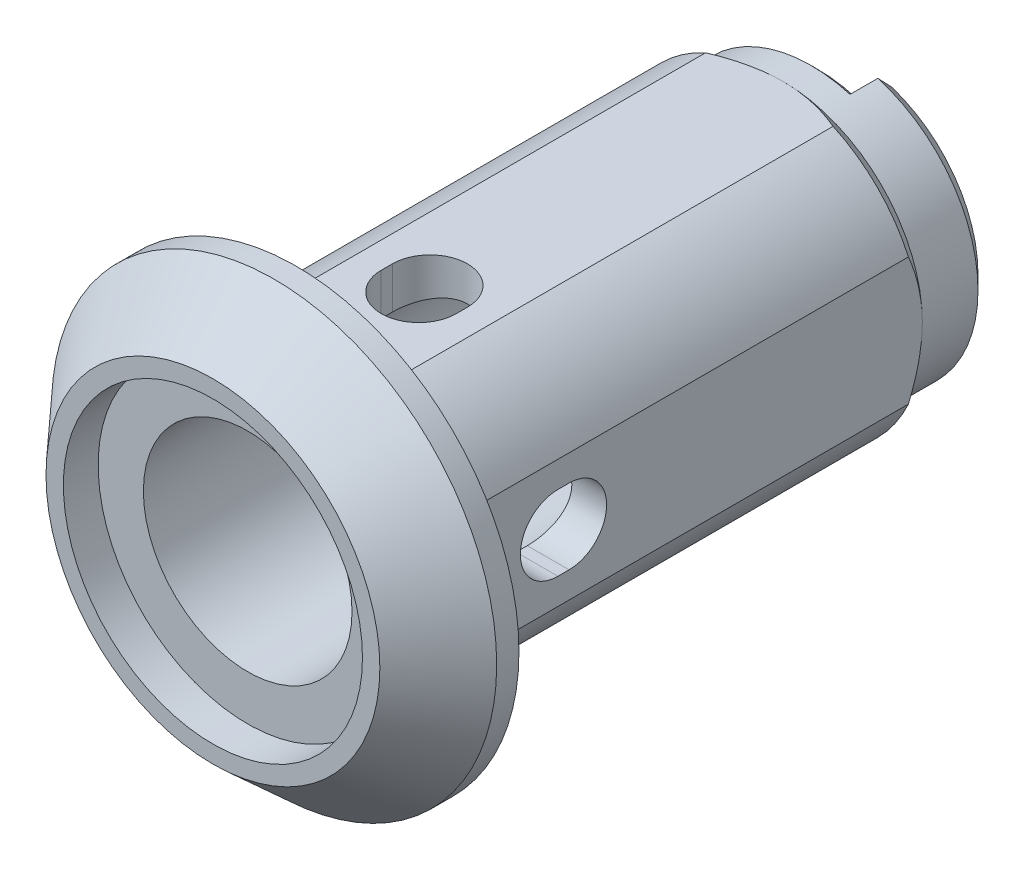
ISO-10303-21;
HEADER;
FILE_DESCRIPTION(('STEP AP214'),'2;1');
FILE_NAME('part.step','',(''),(''),'','','');
FILE_SCHEMA(('AUTOMOTIVE_DESIGN { 1 0 10303 214 1 1 1 1 }'));
ENDSEC;
DATA;
#1=APPLICATION_CONTEXT('core data for automotive mechanical design processes');
#2=APPLICATION_PROTOCOL_DEFINITION('international standard','automotive_design',2000,#1);
#3=PRODUCT_CONTEXT('',#1,'mechanical');
#4=PRODUCT('Part','Part','',(#3));
#5=PRODUCT_RELATED_PRODUCT_CATEGORY('part','',(#4));
#6=PRODUCT_DEFINITION_FORMATION('','',#4);
#7=PRODUCT_DEFINITION_CONTEXT('part definition',#1,'design');
#8=PRODUCT_DEFINITION('design','',#6,#7);
#9=PRODUCT_DEFINITION_SHAPE('','',#8);
#10=(LENGTH_UNIT() NAMED_UNIT(*) SI_UNIT(.MILLI.,.METRE.));
#11=(NAMED_UNIT(*) PLANE_ANGLE_UNIT() SI_UNIT($,.RADIAN.));
#12=(NAMED_UNIT(*) SI_UNIT($,.STERADIAN.) SOLID_ANGLE_UNIT());
#13=UNCERTAINTY_MEASURE_WITH_UNIT(LENGTH_MEASURE(1.E-05),#10,'distance_accuracy_value','');
#14=(GEOMETRIC_REPRESENTATION_CONTEXT(3) GLOBAL_UNCERTAINTY_ASSIGNED_CONTEXT((#13)) GLOBAL_UNIT_ASSIGNED_CONTEXT((#10,
#11,#12)) REPRESENTATION_CONTEXT('',''));
#15=CARTESIAN_POINT('',(0.,0.,0.));
#16=DIRECTION('',(0.,0.,1.));
#17=DIRECTION('',(1.,0.,0.));
#18=AXIS2_PLACEMENT_3D('',#15,#16,#17);
#19=CARTESIAN_POINT('',(0.,0.,1.59999999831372));
#20=DIRECTION('',(0.,0.,-1.));
#21=DIRECTION('',(-1.,0.,0.));
#22=AXIS2_PLACEMENT_3D('',#19,#20,#21);
#23=CONICAL_SURFACE('',#22,15.9999999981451,0.737815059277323);
#24=CARTESIAN_POINT('',(0.,0.,1.6));
#25=DIRECTION('',(0.,0.,1.));
#26=DIRECTION('',(1.,0.,0.));
#27=AXIS2_PLACEMENT_3D('',#24,#25,#26);
#28=CIRCLE('',#27,16.);
#29=CARTESIAN_POINT('',(15.9999999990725,0.,1.59999999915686));
#30=VERTEX_POINT('',#29);
#31=EDGE_CURVE('E35',#30,#30,#28,.F.);
#32=ORIENTED_EDGE('',*,*,#31,.F.);
#33=EDGE_LOOP('',(#32));
#34=FACE_BOUND('',#33,.T.);
#35=CARTESIAN_POINT('',(0.,0.,6.00000000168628));
#36=DIRECTION('',(0.,0.,-1.));
#37=DIRECTION('',(-1.,0.,0.));
#38=AXIS2_PLACEMENT_3D('',#35,#36,#37);
#39=CIRCLE('',#38,12.0000000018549);
#40=CARTESIAN_POINT('',(12.0000000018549,0.,6.00000000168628));
#41=VERTEX_POINT('',#40);
#42=EDGE_CURVE('E309',#41,#41,#39,.F.);
#43=ORIENTED_EDGE('',*,*,#42,.F.);
#44=EDGE_LOOP('',(#43));
#45=FACE_BOUND('',#44,.T.);
#46=ADVANCED_FACE('F15',(#34,#45),#23,.T.);
#47=CARTESIAN_POINT('',(0.,0.,-38.9999999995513));
#48=DIRECTION('',(0.,0.,1.));
#49=DIRECTION('',(1.,0.,0.));
#50=AXIS2_PLACEMENT_3D('',#47,#48,#49);
#51=CONICAL_SURFACE('',#50,9.99999999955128,0.7853981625);
#52=CARTESIAN_POINT('',(0.,0.,-39.));
#53=DIRECTION('',(0.,0.,1.));
#54=DIRECTION('',(1.,0.,0.));
#55=AXIS2_PLACEMENT_3D('',#52,#53,#54);
#56=CIRCLE('',#55,10.);
#57=CARTESIAN_POINT('',(-9.59999999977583,-2.8,-38.9999999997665));
#58=VERTEX_POINT('',#57);
#59=CARTESIAN_POINT('',(2.8,9.59999999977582,-38.9999999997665));
#60=VERTEX_POINT('',#59);
#61=EDGE_CURVE('E263',#58,#60,#56,.T.);
#62=ORIENTED_EDGE('',*,*,#61,.F.);
#63=CARTESIAN_POINT('',(-9.59999999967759,-2.80000000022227,-38.9999999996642));
#64=CARTESIAN_POINT('',(-9.42597854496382,-2.80000000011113,-39.1671043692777));
#65=CARTESIAN_POINT('',(-9.25174798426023,-2.80000000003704,-39.3339898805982));
#66=CARTESIAN_POINT('',(-8.90286862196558,-2.79999999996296,-39.6673232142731));
#67=CARTESIAN_POINT('',(-8.72821982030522,-2.79999999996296,-39.8337710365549));
#68=CARTESIAN_POINT('',(-8.55336191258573,-2.8,-40.0000000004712));
#69=B_SPLINE_CURVE_WITH_KNOTS('',3,(#63,#64,#65,#66,#67,#68),.UNSPECIFIED.,.F.,.F.,(4,2,4),(0.,
0.723784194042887,1.44756850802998),.UNSPECIFIED.);
#70=CARTESIAN_POINT('',(-8.55336191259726,-2.8,-40.0000000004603));
#71=VERTEX_POINT('',#70);
#72=EDGE_CURVE('E293',#58,#71,#69,.T.);
#73=ORIENTED_EDGE('',*,*,#72,.T.);
#74=CARTESIAN_POINT('',(0.,0.,-40.0000000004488));
#75=DIRECTION('',(0.,0.,1.));
#76=DIRECTION('',(1.,0.,0.));
#77=AXIS2_PLACEMENT_3D('',#74,#75,#76);
#78=CIRCLE('',#77,9.00000000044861);
#79=CARTESIAN_POINT('',(2.8,8.55336191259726,-40.0000000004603));
#80=VERTEX_POINT('',#79);
#81=EDGE_CURVE('E266',#71,#80,#78,.T.);
#82=ORIENTED_EDGE('',*,*,#81,.T.);
#83=CARTESIAN_POINT('',(2.7999999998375,8.55336191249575,-40.0000000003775));
#84=CARTESIAN_POINT('',(2.79999999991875,8.72821982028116,-39.83377103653));
#85=CARTESIAN_POINT('',(2.79999999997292,8.90286862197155,-39.6673232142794));
#86=CARTESIAN_POINT('',(2.80000000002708,9.25174798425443,-39.3339898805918));
#87=CARTESIAN_POINT('',(2.80000000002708,9.42597854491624,-39.1671043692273));
#88=CARTESIAN_POINT('',(2.8,9.59999999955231,-38.9999999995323));
#89=B_SPLINE_CURVE_WITH_KNOTS('',3,(#83,#84,#85,#86,#87,#88),.UNSPECIFIED.,.F.,.F.,(4,2,4),(0.,
0.723784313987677,1.44756850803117),.UNSPECIFIED.);
#90=EDGE_CURVE('E18',#80,#60,#89,.T.);
#91=ORIENTED_EDGE('',*,*,#90,.T.);
#92=EDGE_LOOP('',(#62,#73,#82,#91));
#93=FACE_BOUND('',#92,.T.);
#94=ADVANCED_FACE('F262',(#93),#51,.T.);
#95=CARTESIAN_POINT('',(0.,0.,-36.9999999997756));
#96=DIRECTION('',(0.,0.,1.));
#97=DIRECTION('',(0.,-1.,0.));
#98=AXIS2_PLACEMENT_3D('',#95,#96,#97);
#99=CONICAL_SURFACE('',#98,9.99999999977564,0.785398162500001);
#100=CARTESIAN_POINT('',(0.,0.,-37.));
#101=DIRECTION('',(0.,0.,1.));
#102=DIRECTION('',(1.,0.,0.));
#103=AXIS2_PLACEMENT_3D('',#100,#101,#102);
#104=CIRCLE('',#103,10.);
#105=CARTESIAN_POINT('',(2.8,9.59999999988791,-36.9999999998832));
#106=VERTEX_POINT('',#105);
#107=CARTESIAN_POINT('',(-9.6,-2.8,-36.9999999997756));
#108=VERTEX_POINT('',#107);
#109=EDGE_CURVE('E268',#106,#108,#104,.T.);
#110=ORIENTED_EDGE('',*,*,#109,.F.);
#111=CARTESIAN_POINT('',(2.80000000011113,9.59999999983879,-36.9999999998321));
#112=CARTESIAN_POINT('',(2.80000000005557,9.51309524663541,-37.0834335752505));
#113=CARTESIAN_POINT('',(2.80000000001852,9.42614248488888,-37.1668170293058));
#114=CARTESIAN_POINT('',(2.79999999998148,9.25214094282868,-37.3334836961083));
#115=CARTESIAN_POINT('',(2.79999999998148,9.16509216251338,-37.4167669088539));
#116=CARTESIAN_POINT('',(2.8,9.07799537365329,-37.5000000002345));
#117=B_SPLINE_CURVE_WITH_KNOTS('',3,(#111,#112,#113,#114,#115,#116),.UNSPECIFIED.,.F.,.F.,(4,2,
4),(0.,0.36141700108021,0.72283400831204),.UNSPECIFIED.);
#118=CARTESIAN_POINT('',(2.8,9.0779953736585,-37.5000000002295));
#119=VERTEX_POINT('',#118);
#120=EDGE_CURVE('E282',#106,#119,#117,.T.);
#121=ORIENTED_EDGE('',*,*,#120,.T.);
#122=CARTESIAN_POINT('',(0.,0.,-37.5000000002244));
#123=DIRECTION('',(0.,0.,1.));
#124=DIRECTION('',(0.,-1.,0.));
#125=AXIS2_PLACEMENT_3D('',#122,#123,#124);
#126=CIRCLE('',#125,9.50000000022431);
#127=CARTESIAN_POINT('',(-9.0779953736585,-2.8,-37.5000000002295));
#128=VERTEX_POINT('',#127);
#129=EDGE_CURVE('E552',#128,#119,#126,.F.);
#130=ORIENTED_EDGE('',*,*,#129,.F.);
#131=CARTESIAN_POINT('',(-9.07799537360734,-2.79999999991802,-37.5000000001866));
#132=CARTESIAN_POINT('',(-9.16509216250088,-2.79999999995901,-37.4167669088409));
#133=CARTESIAN_POINT('',(-9.25214094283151,-2.79999999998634,-37.3334836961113));
#134=CARTESIAN_POINT('',(-9.42614248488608,-2.80000000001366,-37.1668170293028));
#135=CARTESIAN_POINT('',(-9.51309524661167,-2.80000000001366,-37.0834335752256));
#136=CARTESIAN_POINT('',(-9.59999999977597,-2.8,-36.9999999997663));
#137=B_SPLINE_CURVE_WITH_KNOTS('',3,(#131,#132,#133,#134,#135,#136),.UNSPECIFIED.,.F.,.F.,(4,2,
4),(0.,0.361417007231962,0.722834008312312),.UNSPECIFIED.);
#138=EDGE_CURVE('E295',#128,#108,#137,.T.);
#139=ORIENTED_EDGE('',*,*,#138,.T.);
#140=EDGE_LOOP('',(#110,#121,#130,#139));
#141=FACE_BOUND('',#140,.T.);
#142=ADVANCED_FACE('F635',(#141),#99,.T.);
#143=CARTESIAN_POINT('',(0.,0.,-40.));
#144=DIRECTION('',(0.,0.,1.));
#145=DIRECTION('',(1.,0.,0.));
#146=AXIS2_PLACEMENT_3D('',#143,#144,#145);
#147=CYLINDRICAL_SURFACE('',#146,10.);
#148=CARTESIAN_POINT('',(0.,0.,-35.0000000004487));
#149=DIRECTION('',(0.,0.,1.));
#150=DIRECTION('',(-1.,0.,0.));
#151=AXIS2_PLACEMENT_3D('',#148,#149,#150);
#152=CIRCLE('',#151,10.0000000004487);
#153=CARTESIAN_POINT('',(0.,-10.0000000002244,-35.0000000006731));
#154=VERTEX_POINT('',#153);
#155=CARTESIAN_POINT('',(10.0000000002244,0.,-35.0000000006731));
#156=VERTEX_POINT('',#155);
#157=EDGE_CURVE('E307',#154,#156,#152,.T.);
#158=ORIENTED_EDGE('',*,*,#157,.F.);
#159=CARTESIAN_POINT('',(0.,0.,-35.0000000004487));
#160=DIRECTION('',(0.,0.,1.));
#161=DIRECTION('',(-1.,0.,0.));
#162=AXIS2_PLACEMENT_3D('',#159,#160,#161);
#163=CIRCLE('',#162,10.0000000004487);
#164=CARTESIAN_POINT('',(-10.0000000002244,0.,-35.0000000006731));
#165=VERTEX_POINT('',#164);
#166=EDGE_CURVE('E305',#165,#154,#163,.T.);
#167=ORIENTED_EDGE('',*,*,#166,.F.);
#168=CARTESIAN_POINT('',(0.,0.,-35.0000000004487));
#169=DIRECTION('',(0.,0.,1.));
#170=DIRECTION('',(-1.,0.,0.));
#171=AXIS2_PLACEMENT_3D('',#168,#169,#170);
#172=CIRCLE('',#171,10.0000000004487);
#173=CARTESIAN_POINT('',(0.,10.0000000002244,-35.0000000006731));
#174=VERTEX_POINT('',#173);
#175=EDGE_CURVE('E545',#174,#165,#172,.T.);
#176=ORIENTED_EDGE('',*,*,#175,.F.);
#177=CARTESIAN_POINT('',(0.,0.,-35.0000000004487));
#178=DIRECTION('',(0.,0.,1.));
#179=DIRECTION('',(-1.,0.,0.));
#180=AXIS2_PLACEMENT_3D('',#177,#178,#179);
#181=CIRCLE('',#180,10.0000000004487);
#182=EDGE_CURVE('E543',#156,#174,#181,.T.);
#183=ORIENTED_EDGE('',*,*,#182,.F.);
#184=EDGE_LOOP('',(#158,#167,#176,#183));
#185=FACE_BOUND('',#184,.T.);
#186=ORIENTED_EDGE('',*,*,#61,.T.);
#187=DIRECTION('',(0.,0.,-1.));
#188=VECTOR('',#187,1.);
#189=CARTESIAN_POINT('',(2.8,9.6,-40.));
#190=LINE('',#189,#188);
#191=EDGE_CURVE('E273',#60,#106,#190,.F.);
#192=ORIENTED_EDGE('',*,*,#191,.T.);
#193=ORIENTED_EDGE('',*,*,#109,.T.);
#194=DIRECTION('',(0.,0.,-1.));
#195=VECTOR('',#194,1.);
#196=CARTESIAN_POINT('',(-9.6,-2.8,-40.));
#197=LINE('',#196,#195);
#198=EDGE_CURVE('E275',#108,#58,#197,.T.);
#199=ORIENTED_EDGE('',*,*,#198,.T.);
#200=EDGE_LOOP('',(#186,#192,#193,#199));
#201=FACE_BOUND('',#200,.T.);
#202=ADVANCED_FACE('F272',(#185,#201),#147,.T.);
#203=CARTESIAN_POINT('',(0.,0.,0.));
#204=DIRECTION('',(0.,0.,1.));
#205=DIRECTION('',(1.,0.,0.));
#206=AXIS2_PLACEMENT_3D('',#203,#204,#205);
#207=CYLINDRICAL_SURFACE('',#206,16.);
#208=ORIENTED_EDGE('',*,*,#31,.T.);
#209=EDGE_LOOP('',(#208));
#210=FACE_BOUND('',#209,.T.);
#211=CARTESIAN_POINT('',(0.,0.,0.));
#212=DIRECTION('',(0.,0.,1.));
#213=DIRECTION('',(1.,0.,0.));
#214=AXIS2_PLACEMENT_3D('',#211,#212,#213);
#215=CIRCLE('',#214,16.);
#216=CARTESIAN_POINT('',(16.,0.,0.));
#217=VERTEX_POINT('',#216);
#218=EDGE_CURVE('E542',#217,#217,#215,.T.);
#219=ORIENTED_EDGE('',*,*,#218,.T.);
#220=EDGE_LOOP('',(#219));
#221=FACE_BOUND('',#220,.T.);
#222=ADVANCED_FACE('F629',(#210,#221),#207,.T.);
#223=CARTESIAN_POINT('',(0.,0.,6.));
#224=DIRECTION('',(0.,0.,1.));
#225=DIRECTION('',(1.,0.,0.));
#226=AXIS2_PLACEMENT_3D('',#223,#224,#225);
#227=PLANE('',#226);
#228=CARTESIAN_POINT('',(0.,0.,6.));
#229=DIRECTION('',(0.,0.,-1.));
#230=DIRECTION('',(-1.,0.,0.));
#231=AXIS2_PLACEMENT_3D('',#228,#229,#230);
#232=CIRCLE('',#231,10.75);
#233=CARTESIAN_POINT('',(10.75,0.,6.));
#234=VERTEX_POINT('',#233);
#235=EDGE_CURVE('E460',#234,#234,#232,.T.);
#236=ORIENTED_EDGE('',*,*,#235,.T.);
#237=EDGE_LOOP('',(#236));
#238=FACE_BOUND('',#237,.T.);
#239=ORIENTED_EDGE('',*,*,#42,.T.);
#240=EDGE_LOOP('',(#239));
#241=FACE_BOUND('',#240,.T.);
#242=ADVANCED_FACE('F623',(#238,#241),#227,.T.);
#243=CARTESIAN_POINT('',(0.,0.,-33.9999999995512));
#244=DIRECTION('',(0.,0.,1.));
#245=DIRECTION('',(1.,0.,0.));
#246=AXIS2_PLACEMENT_3D('',#243,#244,#245);
#247=CONICAL_SURFACE('',#246,10.9999999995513,0.7853981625);
#248=CARTESIAN_POINT('',(4.5825756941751,-10.,-33.9999999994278));
#249=CARTESIAN_POINT('',(4.40028329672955,-10.,-34.0759299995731));
#250=CARTESIAN_POINT('',(4.21668434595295,-10.,-34.1486818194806));
#251=CARTESIAN_POINT('',(3.84668711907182,-10.,-34.2870431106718));
#252=CARTESIAN_POINT('',(3.66028713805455,-10.,-34.3526480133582));
#253=CARTESIAN_POINT('',(3.10086162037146,-10.,-34.5361412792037));
#254=CARTESIAN_POINT('',(2.72381902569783,-10.,-34.6423213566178));
#255=CARTESIAN_POINT('',(2.15145029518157,-10.,-34.7728762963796));
#256=CARTESIAN_POINT('',(1.95932775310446,-10.,-34.8116334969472));
#257=CARTESIAN_POINT('',(1.57326186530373,-10.,-34.8787828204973));
#258=CARTESIAN_POINT('',(1.37931860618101,-10.,-34.9071754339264));
#259=CARTESIAN_POINT('',(0.988206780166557,-10.,-34.953182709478));
#260=CARTESIAN_POINT('',(0.791025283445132,-10.,-34.9706880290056));
#261=CARTESIAN_POINT('',(0.395902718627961,-10.,-34.9941229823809));
#262=CARTESIAN_POINT('',(0.197961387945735,-10.,-35.0000481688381));
#263=CARTESIAN_POINT('',(-7.5597072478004E-12,-10.,-35.0000000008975));
#264=B_SPLINE_CURVE_WITH_KNOTS('',3,(#248,#249,#250,#251,#252,#253,#254,#255,#256,#257,#258,
#259,#260,#261,#262,#263),.UNSPECIFIED.,.F.,.F.,(4,2,2,2,2,2,2,4),(0.,0.592342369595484,
1.18506119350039,2.35817128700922,2.94592281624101,3.53364652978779,4.12718135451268,
4.72094408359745),.UNSPECIFIED.);
#265=CARTESIAN_POINT('',(4.58257569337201,-10.,-33.9999999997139));
#266=VERTEX_POINT('',#265);
#267=EDGE_CURVE('E581',#266,#154,#264,.T.);
#268=ORIENTED_EDGE('',*,*,#267,.T.);
#269=ORIENTED_EDGE('',*,*,#157,.T.);
#270=CARTESIAN_POINT('',(10.0000000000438,0.,-35.0000000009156));
#271=CARTESIAN_POINT('',(10.0000000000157,-0.153419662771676,-35.0000177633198));
#272=CARTESIAN_POINT('',(10.0000000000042,-0.30683326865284,-34.9964698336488));
#273=CARTESIAN_POINT('',(9.99999999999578,-0.613315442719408,-34.9823745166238));
#274=CARTESIAN_POINT('',(9.99999999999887,-0.766384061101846,-34.9718282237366));
#275=CARTESIAN_POINT('',(10.0000000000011,-1.07166096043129,-34.9438891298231));
#276=CARTESIAN_POINT('',(10.0000000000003,-1.22387019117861,-34.9265066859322));
#277=CARTESIAN_POINT('',(9.99999999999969,-1.52738320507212,-34.8851453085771));
#278=CARTESIAN_POINT('',(9.99999999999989,-1.67868696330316,-34.8611661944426));
#279=CARTESIAN_POINT('',(10.0000000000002,-2.12685071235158,-34.7805087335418));
#280=CARTESIAN_POINT('',(10.0000000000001,-2.42210425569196,-34.7147147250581));
#281=CARTESIAN_POINT('',(9.99999999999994,-3.00688490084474,-34.5615326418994));
#282=CARTESIAN_POINT('',(9.99999999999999,-3.29641147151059,-34.4741425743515));
#283=CARTESIAN_POINT('',(10.,-3.75125759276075,-34.3207320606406));
#284=CARTESIAN_POINT('',(10.,-3.91864293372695,-34.2607244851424));
#285=CARTESIAN_POINT('',(10.,-4.25191341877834,-34.1346928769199));
#286=CARTESIAN_POINT('',(9.99999999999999,-4.41778971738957,-34.0686454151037));
#287=CARTESIAN_POINT('',(10.,-4.58257569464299,-33.9999999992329));
#288=B_SPLINE_CURVE_WITH_KNOTS('',3,(#270,#271,#272,#273,#274,#275,#276,#277,#278,#279,#280,
#281,#282,#283,#284,#285,#286,#287),.UNSPECIFIED.,.F.,.F.,(4,2,2,2,2,2,2,2,4),(0.,
0.460207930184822,0.92034390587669,1.3797854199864,1.8392395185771,2.74570852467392,
3.65226121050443,4.18561484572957,4.72113306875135),.UNSPECIFIED.);
#289=CARTESIAN_POINT('',(10.,-4.58257569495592,-33.9999999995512));
#290=VERTEX_POINT('',#289);
#291=EDGE_CURVE('E511',#156,#290,#288,.T.);
#292=ORIENTED_EDGE('',*,*,#291,.T.);
#293=CARTESIAN_POINT('',(0.,0.,-34.));
#294=DIRECTION('',(0.,0.,-1.));
#295=DIRECTION('',(-1.,0.,0.));
#296=AXIS2_PLACEMENT_3D('',#293,#294,#295);
#297=CIRCLE('',#296,11.);
#298=EDGE_CURVE('E296',#266,#290,#297,.F.);
#299=ORIENTED_EDGE('',*,*,#298,.F.);
#300=EDGE_LOOP('',(#268,#269,#292,#299));
#301=FACE_BOUND('',#300,.T.);
#302=ADVANCED_FACE('F618',(#301),#247,.T.);
#303=CARTESIAN_POINT('',(0.,0.,-33.9999999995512));
#304=DIRECTION('',(0.,0.,1.));
#305=DIRECTION('',(1.,0.,0.));
#306=AXIS2_PLACEMENT_3D('',#303,#304,#305);
#307=CONICAL_SURFACE('',#306,10.9999999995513,0.7853981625);
#308=CARTESIAN_POINT('',(0.,-10.0000000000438,-35.0000000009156));
#309=CARTESIAN_POINT('',(-0.153419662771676,-10.0000000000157,-35.0000177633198));
#310=CARTESIAN_POINT('',(-0.30683326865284,-10.0000000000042,-34.9964698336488));
#311=CARTESIAN_POINT('',(-0.613315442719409,-9.99999999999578,-34.9823745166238));
#312=CARTESIAN_POINT('',(-0.766384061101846,-9.99999999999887,-34.9718282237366));
#313=CARTESIAN_POINT('',(-1.07166096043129,-10.0000000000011,-34.9438891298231));
#314=CARTESIAN_POINT('',(-1.22387019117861,-10.0000000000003,-34.9265066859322));
#315=CARTESIAN_POINT('',(-1.52738320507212,-9.99999999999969,-34.8851453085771));
#316=CARTESIAN_POINT('',(-1.67868696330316,-9.99999999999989,-34.8611661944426));
#317=CARTESIAN_POINT('',(-2.12685071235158,-10.0000000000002,-34.7805087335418));
#318=CARTESIAN_POINT('',(-2.42210425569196,-10.0000000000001,-34.7147147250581));
#319=CARTESIAN_POINT('',(-3.00688490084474,-9.99999999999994,-34.5615326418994));
#320=CARTESIAN_POINT('',(-3.29641147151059,-9.99999999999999,-34.4741425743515));
#321=CARTESIAN_POINT('',(-3.75125759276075,-10.,-34.3207320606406));
#322=CARTESIAN_POINT('',(-3.91864293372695,-10.,-34.2607244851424));
#323=CARTESIAN_POINT('',(-4.25191341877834,-10.,-34.1346928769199));
#324=CARTESIAN_POINT('',(-4.41778971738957,-9.99999999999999,-34.0686454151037));
#325=CARTESIAN_POINT('',(-4.58257569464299,-10.,-33.9999999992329));
#326=B_SPLINE_CURVE_WITH_KNOTS('',3,(#308,#309,#310,#311,#312,#313,#314,#315,#316,#317,#318,
#319,#320,#321,#322,#323,#324,#325),.UNSPECIFIED.,.F.,.F.,(4,2,2,2,2,2,2,2,4),(0.,
0.460207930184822,0.92034390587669,1.3797854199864,1.8392395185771,2.74570852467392,
3.65226121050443,4.18561484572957,4.72113306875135),.UNSPECIFIED.);
#327=CARTESIAN_POINT('',(-4.58257569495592,-10.,-33.9999999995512));
#328=VERTEX_POINT('',#327);
#329=EDGE_CURVE('E578',#154,#328,#326,.T.);
#330=ORIENTED_EDGE('',*,*,#329,.T.);
#331=CARTESIAN_POINT('',(0.,0.,-34.));
#332=DIRECTION('',(0.,0.,-1.));
#333=DIRECTION('',(-1.,0.,0.));
#334=AXIS2_PLACEMENT_3D('',#331,#332,#333);
#335=CIRCLE('',#334,11.);
#336=CARTESIAN_POINT('',(-10.,-4.58257569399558,-33.9999999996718));
#337=VERTEX_POINT('',#336);
#338=EDGE_CURVE('E298',#337,#328,#335,.F.);
#339=ORIENTED_EDGE('',*,*,#338,.F.);
#340=CARTESIAN_POINT('',(-10.,-4.58257569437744,-33.9999999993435));
#341=CARTESIAN_POINT('',(-10.,-4.40028329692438,-34.0759299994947));
#342=CARTESIAN_POINT('',(-10.,-4.21668434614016,-34.1486818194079));
#343=CARTESIAN_POINT('',(-10.,-3.84668711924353,-34.2870431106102));
#344=CARTESIAN_POINT('',(-10.,-3.66028713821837,-34.352648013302));
#345=CARTESIAN_POINT('',(-10.,-3.10086162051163,-34.5361412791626));
#346=CARTESIAN_POINT('',(-10.,-2.7238190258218,-34.6423213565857));
#347=CARTESIAN_POINT('',(-10.,-2.15145029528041,-34.7728762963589));
#348=CARTESIAN_POINT('',(-10.,-1.95932775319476,-34.81163349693));
#349=CARTESIAN_POINT('',(-10.,-1.57326186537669,-34.8787828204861));
#350=CARTESIAN_POINT('',(-10.,-1.37931860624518,-34.9071754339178));
#351=CARTESIAN_POINT('',(-10.,-0.988206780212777,-34.9531827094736));
#352=CARTESIAN_POINT('',(-10.,-0.791025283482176,-34.9706880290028));
#353=CARTESIAN_POINT('',(-10.,-0.395902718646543,-34.9941229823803));
#354=CARTESIAN_POINT('',(-10.,-0.19796138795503,-35.0000481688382));
#355=CARTESIAN_POINT('',(-10.,7.55736105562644E-12,-35.0000000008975));
#356=B_SPLINE_CURVE_WITH_KNOTS('',3,(#340,#341,#342,#343,#344,#345,#346,#347,#348,#349,#350,
#351,#352,#353,#354,#355),.UNSPECIFIED.,.F.,.F.,(4,2,2,2,2,2,2,4),(0.,0.592342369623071,
1.18506119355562,2.35817128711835,2.9459228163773,3.53364652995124,4.12718135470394,
4.72094408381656),.UNSPECIFIED.);
#357=EDGE_CURVE('E459',#337,#165,#356,.T.);
#358=ORIENTED_EDGE('',*,*,#357,.T.);
#359=ORIENTED_EDGE('',*,*,#166,.T.);
#360=EDGE_LOOP('',(#330,#339,#358,#359));
#361=FACE_BOUND('',#360,.T.);
#362=ADVANCED_FACE('F622',(#361),#307,.T.);
#363=CARTESIAN_POINT('',(0.,0.,0.));
#364=DIRECTION('',(0.,0.,-1.));
#365=DIRECTION('',(-1.,0.,0.));
#366=AXIS2_PLACEMENT_3D('',#363,#364,#365);
#367=CYLINDRICAL_SURFACE('',#366,11.);
#368=DIRECTION('',(0.,0.,1.));
#369=VECTOR('',#368,1.);
#370=CARTESIAN_POINT('',(-4.582575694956,-10.,0.));
#371=LINE('',#370,#369);
#372=CARTESIAN_POINT('',(-4.58257569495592,-10.,0.));
#373=VERTEX_POINT('',#372);
#374=EDGE_CURVE('E303',#328,#373,#371,.T.);
#375=ORIENTED_EDGE('',*,*,#374,.T.);
#376=CARTESIAN_POINT('',(0.,0.,0.));
#377=DIRECTION('',(0.,0.,-1.));
#378=DIRECTION('',(-1.,0.,0.));
#379=AXIS2_PLACEMENT_3D('',#376,#377,#378);
#380=CIRCLE('',#379,11.);
#381=CARTESIAN_POINT('',(-10.,-4.58257569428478,0.));
#382=VERTEX_POINT('',#381);
#383=EDGE_CURVE('E673',#373,#382,#380,.T.);
#384=ORIENTED_EDGE('',*,*,#383,.T.);
#385=DIRECTION('',(0.,0.,-1.));
#386=VECTOR('',#385,1.);
#387=CARTESIAN_POINT('',(-10.,-4.58257569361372,0.));
#388=LINE('',#387,#386);
#389=EDGE_CURVE('E318',#382,#337,#388,.T.);
#390=ORIENTED_EDGE('',*,*,#389,.T.);
#391=ORIENTED_EDGE('',*,*,#338,.T.);
#392=EDGE_LOOP('',(#375,#384,#390,#391));
#393=FACE_BOUND('',#392,.T.);
#394=ADVANCED_FACE('F665',(#393),#367,.T.);
#395=CARTESIAN_POINT('',(0.,0.,0.));
#396=DIRECTION('',(0.,0.,-1.));
#397=DIRECTION('',(-1.,0.,0.));
#398=AXIS2_PLACEMENT_3D('',#395,#396,#397);
#399=CYLINDRICAL_SURFACE('',#398,11.);
#400=DIRECTION('',(0.,0.,1.));
#401=VECTOR('',#400,1.);
#402=CARTESIAN_POINT('',(4.58257569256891,-10.,0.));
#403=LINE('',#402,#401);
#404=CARTESIAN_POINT('',(4.58257569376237,-10.,0.));
#405=VERTEX_POINT('',#404);
#406=EDGE_CURVE('E302',#405,#266,#403,.F.);
#407=ORIENTED_EDGE('',*,*,#406,.T.);
#408=ORIENTED_EDGE('',*,*,#298,.T.);
#409=DIRECTION('',(0.,0.,1.));
#410=VECTOR('',#409,1.);
#411=CARTESIAN_POINT('',(10.,-4.582575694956,0.));
#412=LINE('',#411,#410);
#413=CARTESIAN_POINT('',(10.,-4.58257569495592,0.));
#414=VERTEX_POINT('',#413);
#415=EDGE_CURVE('E514',#290,#414,#412,.T.);
#416=ORIENTED_EDGE('',*,*,#415,.T.);
#417=CARTESIAN_POINT('',(0.,0.,0.));
#418=DIRECTION('',(0.,0.,-1.));
#419=DIRECTION('',(-1.,0.,0.));
#420=AXIS2_PLACEMENT_3D('',#417,#418,#419);
#421=CIRCLE('',#420,11.);
#422=EDGE_CURVE('E824',#414,#405,#421,.T.);
#423=ORIENTED_EDGE('',*,*,#422,.T.);
#424=EDGE_LOOP('',(#407,#408,#416,#423));
#425=FACE_BOUND('',#424,.T.);
#426=ADVANCED_FACE('F662',(#425),#399,.T.);
#427=CARTESIAN_POINT('',(-4.142463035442,-2.8,-40.));
#428=DIRECTION('',(0.,-1.,0.));
#429=DIRECTION('',(0.,0.,-1.));
#430=AXIS2_PLACEMENT_3D('',#427,#428,#429);
#431=PLANE('',#430);
#432=ORIENTED_EDGE('',*,*,#72,.F.);
#433=ORIENTED_EDGE('',*,*,#198,.F.);
#434=ORIENTED_EDGE('',*,*,#138,.F.);
#435=DIRECTION('',(-1.,0.,0.));
#436=VECTOR('',#435,1.);
#437=CARTESIAN_POINT('',(0.,-2.8,-37.5));
#438=LINE('',#437,#436);
#439=CARTESIAN_POINT('',(-4.14246303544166,-2.79999999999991,-37.5));
#440=VERTEX_POINT('',#439);
#441=EDGE_CURVE('E547',#440,#128,#438,.T.);
#442=ORIENTED_EDGE('',*,*,#441,.F.);
#443=DIRECTION('',(0.,0.,1.));
#444=VECTOR('',#443,1.);
#445=CARTESIAN_POINT('',(-4.14246303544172,-2.79999999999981,-40.));
#446=LINE('',#445,#444);
#447=CARTESIAN_POINT('',(-4.14246303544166,-2.79999999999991,-40.));
#448=VERTEX_POINT('',#447);
#449=EDGE_CURVE('E555',#440,#448,#446,.F.);
#450=ORIENTED_EDGE('',*,*,#449,.T.);
#451=DIRECTION('',(1.,0.,0.));
#452=VECTOR('',#451,1.);
#453=CARTESIAN_POINT('',(0.,-2.8,-40.));
#454=LINE('',#453,#452);
#455=EDGE_CURVE('E286',#448,#71,#454,.F.);
#456=ORIENTED_EDGE('',*,*,#455,.T.);
#457=EDGE_LOOP('',(#432,#433,#434,#442,#450,#456));
#458=FACE_BOUND('',#457,.T.);
#459=ADVANCED_FACE('F656',(#458),#431,.F.);
#460=CARTESIAN_POINT('',(0.,0.,-40.));
#461=DIRECTION('',(0.,0.,1.));
#462=DIRECTION('',(1.,0.,0.));
#463=AXIS2_PLACEMENT_3D('',#460,#461,#462);
#464=PLANE('',#463);
#465=ORIENTED_EDGE('',*,*,#81,.F.);
#466=ORIENTED_EDGE('',*,*,#455,.F.);
#467=CARTESIAN_POINT('',(0.,0.,-40.));
#468=DIRECTION('',(0.,0.,1.));
#469=DIRECTION('',(1.,0.,0.));
#470=AXIS2_PLACEMENT_3D('',#467,#468,#469);
#471=CIRCLE('',#470,5.);
#472=CARTESIAN_POINT('',(2.79999999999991,4.14246303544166,-40.));
#473=VERTEX_POINT('',#472);
#474=EDGE_CURVE('E554',#448,#473,#471,.T.);
#475=ORIENTED_EDGE('',*,*,#474,.T.);
#476=DIRECTION('',(0.,1.,0.));
#477=VECTOR('',#476,1.);
#478=CARTESIAN_POINT('',(2.8,10.,-40.));
#479=LINE('',#478,#477);
#480=EDGE_CURVE('E284',#473,#80,#479,.T.);
#481=ORIENTED_EDGE('',*,*,#480,.T.);
#482=EDGE_LOOP('',(#465,#466,#475,#481));
#483=FACE_BOUND('',#482,.T.);
#484=ADVANCED_FACE('F661',(#483),#464,.F.);
#485=CARTESIAN_POINT('',(2.8,10.,-40.));
#486=DIRECTION('',(1.,0.,0.));
#487=DIRECTION('',(0.,0.,-1.));
#488=AXIS2_PLACEMENT_3D('',#485,#486,#487);
#489=PLANE('',#488);
#490=DIRECTION('',(0.,0.,1.));
#491=VECTOR('',#490,1.);
#492=CARTESIAN_POINT('',(2.79999999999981,4.14246303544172,-40.));
#493=LINE('',#492,#491);
#494=CARTESIAN_POINT('',(2.79999999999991,4.14246303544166,-37.5));
#495=VERTEX_POINT('',#494);
#496=EDGE_CURVE('E553',#473,#495,#493,.T.);
#497=ORIENTED_EDGE('',*,*,#496,.T.);
#498=DIRECTION('',(0.,1.,0.));
#499=VECTOR('',#498,1.);
#500=CARTESIAN_POINT('',(2.8,0.,-37.5));
#501=LINE('',#500,#499);
#502=EDGE_CURVE('E550',#119,#495,#501,.F.);
#503=ORIENTED_EDGE('',*,*,#502,.F.);
#504=ORIENTED_EDGE('',*,*,#120,.F.);
#505=ORIENTED_EDGE('',*,*,#191,.F.);
#506=ORIENTED_EDGE('',*,*,#90,.F.);
#507=ORIENTED_EDGE('',*,*,#480,.F.);
#508=EDGE_LOOP('',(#497,#503,#504,#505,#506,#507));
#509=FACE_BOUND('',#508,.T.);
#510=ADVANCED_FACE('F279',(#509),#489,.F.);
#511=CARTESIAN_POINT('',(0.,0.,-37.5));
#512=DIRECTION('',(0.,0.,-1.));
#513=DIRECTION('',(-1.,0.,0.));
#514=AXIS2_PLACEMENT_3D('',#511,#512,#513);
#515=PLANE('',#514);
#516=CARTESIAN_POINT('',(0.,0.,-37.5));
#517=DIRECTION('',(0.,0.,1.));
#518=DIRECTION('',(1.,0.,0.));
#519=AXIS2_PLACEMENT_3D('',#516,#517,#518);
#520=CIRCLE('',#519,5.);
#521=EDGE_CURVE('E438',#495,#440,#520,.T.);
#522=ORIENTED_EDGE('',*,*,#521,.T.);
#523=ORIENTED_EDGE('',*,*,#441,.T.);
#524=ORIENTED_EDGE('',*,*,#129,.T.);
#525=ORIENTED_EDGE('',*,*,#502,.T.);
#526=EDGE_LOOP('',(#522,#523,#524,#525));
#527=FACE_BOUND('',#526,.T.);
#528=ADVANCED_FACE('F445',(#527),#515,.T.);
#529=CARTESIAN_POINT('',(0.,0.,-33.9999999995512));
#530=DIRECTION('',(0.,0.,1.));
#531=DIRECTION('',(1.,0.,0.));
#532=AXIS2_PLACEMENT_3D('',#529,#530,#531);
#533=CONICAL_SURFACE('',#532,10.9999999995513,0.7853981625);
#534=CARTESIAN_POINT('',(-4.5825756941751,10.,-33.9999999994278));
#535=CARTESIAN_POINT('',(-4.40028329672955,10.,-34.0759299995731));
#536=CARTESIAN_POINT('',(-4.21668434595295,10.,-34.1486818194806));
#537=CARTESIAN_POINT('',(-3.84668711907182,10.,-34.2870431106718));
#538=CARTESIAN_POINT('',(-3.66028713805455,10.,-34.3526480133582));
#539=CARTESIAN_POINT('',(-3.10086162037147,10.,-34.5361412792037));
#540=CARTESIAN_POINT('',(-2.72381902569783,10.,-34.6423213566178));
#541=CARTESIAN_POINT('',(-2.15145029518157,10.,-34.7728762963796));
#542=CARTESIAN_POINT('',(-1.95932775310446,10.,-34.8116334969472));
#543=CARTESIAN_POINT('',(-1.57326186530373,10.,-34.8787828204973));
#544=CARTESIAN_POINT('',(-1.37931860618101,10.,-34.9071754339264));
#545=CARTESIAN_POINT('',(-0.988206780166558,10.,-34.953182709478));
#546=CARTESIAN_POINT('',(-0.791025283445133,10.,-34.9706880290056));
#547=CARTESIAN_POINT('',(-0.395902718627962,10.,-34.9941229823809));
#548=CARTESIAN_POINT('',(-0.197961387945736,10.,-35.0000481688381));
#549=CARTESIAN_POINT('',(7.55894872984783E-12,10.,-35.0000000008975));
#550=B_SPLINE_CURVE_WITH_KNOTS('',3,(#534,#535,#536,#537,#538,#539,#540,#541,#542,#543,#544,
#545,#546,#547,#548,#549),.UNSPECIFIED.,.F.,.F.,(4,2,2,2,2,2,2,4),(0.,0.592342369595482,
1.18506119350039,2.35817128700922,2.94592281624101,3.53364652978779,4.12718135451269,
4.72094408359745),.UNSPECIFIED.);
#551=CARTESIAN_POINT('',(-4.58257569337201,10.,-33.9999999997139));
#552=VERTEX_POINT('',#551);
#553=EDGE_CURVE('E430',#552,#174,#550,.T.);
#554=ORIENTED_EDGE('',*,*,#553,.T.);
#555=ORIENTED_EDGE('',*,*,#175,.T.);
#556=CARTESIAN_POINT('',(-10.0000000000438,0.,-35.0000000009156));
#557=CARTESIAN_POINT('',(-10.0000000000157,0.153419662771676,-35.0000177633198));
#558=CARTESIAN_POINT('',(-10.0000000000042,0.306833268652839,-34.9964698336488));
#559=CARTESIAN_POINT('',(-9.99999999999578,0.613315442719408,-34.9823745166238));
#560=CARTESIAN_POINT('',(-9.99999999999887,0.766384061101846,-34.9718282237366));
#561=CARTESIAN_POINT('',(-10.0000000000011,1.07166096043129,-34.9438891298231));
#562=CARTESIAN_POINT('',(-10.0000000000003,1.22387019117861,-34.9265066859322));
#563=CARTESIAN_POINT('',(-9.99999999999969,1.52738320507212,-34.8851453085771));
#564=CARTESIAN_POINT('',(-9.99999999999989,1.67868696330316,-34.8611661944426));
#565=CARTESIAN_POINT('',(-10.0000000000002,2.12685071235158,-34.7805087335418));
#566=CARTESIAN_POINT('',(-10.0000000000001,2.42210425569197,-34.7147147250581));
#567=CARTESIAN_POINT('',(-9.99999999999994,3.00688490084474,-34.5615326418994));
#568=CARTESIAN_POINT('',(-9.99999999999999,3.29641147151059,-34.4741425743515));
#569=CARTESIAN_POINT('',(-10.,3.75125759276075,-34.3207320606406));
#570=CARTESIAN_POINT('',(-10.,3.91864293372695,-34.2607244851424));
#571=CARTESIAN_POINT('',(-10.,4.25191341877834,-34.1346928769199));
#572=CARTESIAN_POINT('',(-9.99999999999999,4.41778971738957,-34.0686454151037));
#573=CARTESIAN_POINT('',(-10.,4.58257569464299,-33.9999999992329));
#574=B_SPLINE_CURVE_WITH_KNOTS('',3,(#556,#557,#558,#559,#560,#561,#562,#563,#564,#565,#566,
#567,#568,#569,#570,#571,#572,#573),.UNSPECIFIED.,.F.,.F.,(4,2,2,2,2,2,2,2,4),(0.,
0.460207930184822,0.92034390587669,1.3797854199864,1.8392395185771,2.74570852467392,
3.65226121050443,4.18561484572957,4.72113306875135),.UNSPECIFIED.);
#575=CARTESIAN_POINT('',(-10.,4.58257569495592,-33.9999999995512));
#576=VERTEX_POINT('',#575);
#577=EDGE_CURVE('E451',#165,#576,#574,.T.);
#578=ORIENTED_EDGE('',*,*,#577,.T.);
#579=CARTESIAN_POINT('',(0.,0.,-34.));
#580=DIRECTION('',(0.,0.,-1.));
#581=DIRECTION('',(-1.,0.,0.));
#582=AXIS2_PLACEMENT_3D('',#579,#580,#581);
#583=CIRCLE('',#582,11.);
#584=EDGE_CURVE('E533',#552,#576,#583,.F.);
#585=ORIENTED_EDGE('',*,*,#584,.F.);
#586=EDGE_LOOP('',(#554,#555,#578,#585));
#587=FACE_BOUND('',#586,.T.);
#588=ADVANCED_FACE('F440',(#587),#533,.T.);
#589=CARTESIAN_POINT('',(0.,0.,-33.9999999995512));
#590=DIRECTION('',(0.,0.,1.));
#591=DIRECTION('',(1.,0.,0.));
#592=AXIS2_PLACEMENT_3D('',#589,#590,#591);
#593=CONICAL_SURFACE('',#592,10.9999999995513,0.7853981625);
#594=CARTESIAN_POINT('',(10.,4.58257569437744,-33.9999999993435));
#595=CARTESIAN_POINT('',(10.,4.40028329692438,-34.0759299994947));
#596=CARTESIAN_POINT('',(10.,4.21668434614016,-34.1486818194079));
#597=CARTESIAN_POINT('',(10.,3.84668711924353,-34.2870431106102));
#598=CARTESIAN_POINT('',(10.,3.66028713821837,-34.352648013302));
#599=CARTESIAN_POINT('',(10.,3.10086162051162,-34.5361412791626));
#600=CARTESIAN_POINT('',(10.,2.7238190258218,-34.6423213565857));
#601=CARTESIAN_POINT('',(10.,2.15145029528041,-34.7728762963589));
#602=CARTESIAN_POINT('',(10.,1.95932775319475,-34.81163349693));
#603=CARTESIAN_POINT('',(10.,1.57326186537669,-34.8787828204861));
#604=CARTESIAN_POINT('',(10.,1.37931860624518,-34.9071754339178));
#605=CARTESIAN_POINT('',(10.,0.988206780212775,-34.9531827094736));
#606=CARTESIAN_POINT('',(10.,0.791025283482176,-34.9706880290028));
#607=CARTESIAN_POINT('',(10.,0.395902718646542,-34.9941229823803));
#608=CARTESIAN_POINT('',(10.,0.197961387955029,-35.0000481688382));
#609=CARTESIAN_POINT('',(10.,-7.55811999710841E-12,-35.0000000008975));
#610=B_SPLINE_CURVE_WITH_KNOTS('',3,(#594,#595,#596,#597,#598,#599,#600,#601,#602,#603,#604,
#605,#606,#607,#608,#609),.UNSPECIFIED.,.F.,.F.,(4,2,2,2,2,2,2,4),(0.,0.592342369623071,
1.18506119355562,2.35817128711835,2.9459228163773,3.53364652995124,4.12718135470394,
4.72094408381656),.UNSPECIFIED.);
#611=CARTESIAN_POINT('',(10.,4.58257569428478,-34.));
#612=VERTEX_POINT('',#611);
#613=EDGE_CURVE('E508',#612,#156,#610,.T.);
#614=ORIENTED_EDGE('',*,*,#613,.T.);
#615=ORIENTED_EDGE('',*,*,#182,.T.);
#616=CARTESIAN_POINT('',(0.,10.0000000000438,-35.0000000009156));
#617=CARTESIAN_POINT('',(0.153419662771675,10.0000000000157,-35.0000177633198));
#618=CARTESIAN_POINT('',(0.30683326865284,10.0000000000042,-34.9964698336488));
#619=CARTESIAN_POINT('',(0.613315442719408,9.99999999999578,-34.9823745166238));
#620=CARTESIAN_POINT('',(0.766384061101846,9.99999999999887,-34.9718282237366));
#621=CARTESIAN_POINT('',(1.07166096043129,10.0000000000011,-34.9438891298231));
#622=CARTESIAN_POINT('',(1.22387019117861,10.0000000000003,-34.9265066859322));
#623=CARTESIAN_POINT('',(1.52738320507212,9.99999999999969,-34.8851453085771));
#624=CARTESIAN_POINT('',(1.67868696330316,9.99999999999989,-34.8611661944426));
#625=CARTESIAN_POINT('',(2.12685071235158,10.0000000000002,-34.7805087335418));
#626=CARTESIAN_POINT('',(2.42210425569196,10.0000000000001,-34.7147147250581));
#627=CARTESIAN_POINT('',(3.00688490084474,9.99999999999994,-34.5615326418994));
#628=CARTESIAN_POINT('',(3.29641147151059,9.99999999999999,-34.4741425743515));
#629=CARTESIAN_POINT('',(3.75125759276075,10.,-34.3207320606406));
#630=CARTESIAN_POINT('',(3.91864293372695,10.,-34.2607244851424));
#631=CARTESIAN_POINT('',(4.25191341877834,10.,-34.1346928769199));
#632=CARTESIAN_POINT('',(4.41778971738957,9.99999999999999,-34.0686454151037));
#633=CARTESIAN_POINT('',(4.58257569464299,10.,-33.9999999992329));
#634=B_SPLINE_CURVE_WITH_KNOTS('',3,(#616,#617,#618,#619,#620,#621,#622,#623,#624,#625,#626,
#627,#628,#629,#630,#631,#632,#633),.UNSPECIFIED.,.F.,.F.,(4,2,2,2,2,2,2,2,4),(0.,
0.460207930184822,0.92034390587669,1.3797854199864,1.8392395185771,2.74570852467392,
3.65226121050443,4.18561484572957,4.72113306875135),.UNSPECIFIED.);
#635=CARTESIAN_POINT('',(4.58257569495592,10.,-33.9999999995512));
#636=VERTEX_POINT('',#635);
#637=EDGE_CURVE('E423',#174,#636,#634,.T.);
#638=ORIENTED_EDGE('',*,*,#637,.T.);
#639=CARTESIAN_POINT('',(0.,0.,-34.));
#640=DIRECTION('',(0.,0.,-1.));
#641=DIRECTION('',(-1.,0.,0.));
#642=AXIS2_PLACEMENT_3D('',#639,#640,#641);
#643=CIRCLE('',#642,11.);
#644=EDGE_CURVE('E502',#612,#636,#643,.F.);
#645=ORIENTED_EDGE('',*,*,#644,.F.);
#646=EDGE_LOOP('',(#614,#615,#638,#645));
#647=FACE_BOUND('',#646,.T.);
#648=ADVANCED_FACE('F444',(#647),#593,.T.);
#649=CARTESIAN_POINT('',(0.,0.,0.));
#650=DIRECTION('',(0.,0.,-1.));
#651=DIRECTION('',(-1.,0.,0.));
#652=AXIS2_PLACEMENT_3D('',#649,#650,#651);
#653=CYLINDRICAL_SURFACE('',#652,11.);
#654=DIRECTION('',(0.,0.,1.));
#655=VECTOR('',#654,1.);
#656=CARTESIAN_POINT('',(10.,4.58257569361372,0.));
#657=LINE('',#656,#655);
#658=CARTESIAN_POINT('',(10.,4.58257569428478,0.));
#659=VERTEX_POINT('',#658);
#660=EDGE_CURVE('E313',#659,#612,#657,.F.);
#661=ORIENTED_EDGE('',*,*,#660,.T.);
#662=ORIENTED_EDGE('',*,*,#644,.T.);
#663=DIRECTION('',(0.,0.,-1.));
#664=VECTOR('',#663,1.);
#665=CARTESIAN_POINT('',(4.582575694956,10.,0.));
#666=LINE('',#665,#664);
#667=CARTESIAN_POINT('',(4.58257569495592,10.,0.));
#668=VERTEX_POINT('',#667);
#669=EDGE_CURVE('E540',#636,#668,#666,.F.);
#670=ORIENTED_EDGE('',*,*,#669,.T.);
#671=CARTESIAN_POINT('',(0.,0.,0.));
#672=DIRECTION('',(0.,0.,-1.));
#673=DIRECTION('',(-1.,0.,0.));
#674=AXIS2_PLACEMENT_3D('',#671,#672,#673);
#675=CIRCLE('',#674,11.);
#676=EDGE_CURVE('E504',#668,#659,#675,.T.);
#677=ORIENTED_EDGE('',*,*,#676,.T.);
#678=EDGE_LOOP('',(#661,#662,#670,#677));
#679=FACE_BOUND('',#678,.T.);
#680=ADVANCED_FACE('F490',(#679),#653,.T.);
#681=CARTESIAN_POINT('',(0.,0.,0.));
#682=DIRECTION('',(0.,0.,1.));
#683=DIRECTION('',(1.,0.,0.));
#684=AXIS2_PLACEMENT_3D('',#681,#682,#683);
#685=PLANE('',#684);
#686=DIRECTION('',(0.,1.,0.));
#687=VECTOR('',#686,1.);
#688=CARTESIAN_POINT('',(-10.,-10.,0.));
#689=LINE('',#688,#687);
#690=CARTESIAN_POINT('',(-10.,4.58257569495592,0.));
#691=VERTEX_POINT('',#690);
#692=EDGE_CURVE('E315',#691,#382,#689,.F.);
#693=ORIENTED_EDGE('',*,*,#692,.T.);
#694=ORIENTED_EDGE('',*,*,#383,.F.);
#695=DIRECTION('',(1.,0.,0.));
#696=VECTOR('',#695,1.);
#697=CARTESIAN_POINT('',(10.,-10.,0.));
#698=LINE('',#697,#696);
#699=EDGE_CURVE('E299',#373,#405,#698,.T.);
#700=ORIENTED_EDGE('',*,*,#699,.T.);
#701=ORIENTED_EDGE('',*,*,#422,.F.);
#702=DIRECTION('',(0.,1.,0.));
#703=VECTOR('',#702,1.);
#704=CARTESIAN_POINT('',(10.,10.,0.));
#705=LINE('',#704,#703);
#706=EDGE_CURVE('E310',#414,#659,#705,.T.);
#707=ORIENTED_EDGE('',*,*,#706,.T.);
#708=ORIENTED_EDGE('',*,*,#676,.F.);
#709=DIRECTION('',(1.,0.,0.));
#710=VECTOR('',#709,1.);
#711=CARTESIAN_POINT('',(-10.,10.,0.));
#712=LINE('',#711,#710);
#713=CARTESIAN_POINT('',(-4.58257569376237,10.,0.));
#714=VERTEX_POINT('',#713);
#715=EDGE_CURVE('E536',#668,#714,#712,.F.);
#716=ORIENTED_EDGE('',*,*,#715,.T.);
#717=CARTESIAN_POINT('',(0.,0.,0.));
#718=DIRECTION('',(0.,0.,-1.));
#719=DIRECTION('',(-1.,0.,0.));
#720=AXIS2_PLACEMENT_3D('',#717,#718,#719);
#721=CIRCLE('',#720,11.);
#722=EDGE_CURVE('E535',#691,#714,#721,.T.);
#723=ORIENTED_EDGE('',*,*,#722,.F.);
#724=EDGE_LOOP('',(#693,#694,#700,#701,#707,#708,#716,#723));
#725=FACE_BOUND('',#724,.T.);
#726=ORIENTED_EDGE('',*,*,#218,.F.);
#727=EDGE_LOOP('',(#726));
#728=FACE_BOUND('',#727,.T.);
#729=ADVANCED_FACE('F487',(#725,#728),#685,.F.);
#730=CARTESIAN_POINT('',(0.,0.,0.));
#731=DIRECTION('',(0.,0.,-1.));
#732=DIRECTION('',(-1.,0.,0.));
#733=AXIS2_PLACEMENT_3D('',#730,#731,#732);
#734=CYLINDRICAL_SURFACE('',#733,11.);
#735=DIRECTION('',(0.,0.,-1.));
#736=VECTOR('',#735,1.);
#737=CARTESIAN_POINT('',(-4.58257569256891,10.,0.));
#738=LINE('',#737,#736);
#739=EDGE_CURVE('E539',#714,#552,#738,.T.);
#740=ORIENTED_EDGE('',*,*,#739,.T.);
#741=ORIENTED_EDGE('',*,*,#584,.T.);
#742=DIRECTION('',(0.,0.,-1.));
#743=VECTOR('',#742,1.);
#744=CARTESIAN_POINT('',(-10.,4.582575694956,0.));
#745=LINE('',#744,#743);
#746=EDGE_CURVE('E319',#576,#691,#745,.F.);
#747=ORIENTED_EDGE('',*,*,#746,.T.);
#748=ORIENTED_EDGE('',*,*,#722,.T.);
#749=EDGE_LOOP('',(#740,#741,#747,#748));
#750=FACE_BOUND('',#749,.T.);
#751=ADVANCED_FACE('F483',(#750),#734,.T.);
#752=CARTESIAN_POINT('',(-10.,-2.7,-9.6));
#753=DIRECTION('',(0.,-1.,0.));
#754=DIRECTION('',(0.,0.,-1.));
#755=AXIS2_PLACEMENT_3D('',#752,#753,#754);
#756=PLANE('',#755);
#757=DIRECTION('',(-1.,0.,0.));
#758=VECTOR('',#757,1.);
#759=CARTESIAN_POINT('',(-10.,-2.7,-8.8));
#760=LINE('',#759,#758);
#761=CARTESIAN_POINT('',(-10.,-2.7,-8.8));
#762=VERTEX_POINT('',#761);
#763=CARTESIAN_POINT('',(-6.99714227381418,-2.7,-8.8));
#764=VERTEX_POINT('',#763);
#765=EDGE_CURVE('E789',#762,#764,#760,.F.);
#766=ORIENTED_EDGE('',*,*,#765,.T.);
#767=DIRECTION('',(0.,0.,-1.));
#768=VECTOR('',#767,1.);
#769=CARTESIAN_POINT('',(-6.997142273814,-2.7,-9.6));
#770=LINE('',#769,#768);
#771=CARTESIAN_POINT('',(-6.99714227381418,-2.7,-9.6));
#772=VERTEX_POINT('',#771);
#773=EDGE_CURVE('E531',#772,#764,#770,.F.);
#774=ORIENTED_EDGE('',*,*,#773,.F.);
#775=DIRECTION('',(-1.,0.,0.));
#776=VECTOR('',#775,1.);
#777=CARTESIAN_POINT('',(-10.,-2.7,-9.6));
#778=LINE('',#777,#776);
#779=CARTESIAN_POINT('',(-10.,-2.7,-9.6));
#780=VERTEX_POINT('',#779);
#781=EDGE_CURVE('E790',#772,#780,#778,.T.);
#782=ORIENTED_EDGE('',*,*,#781,.T.);
#783=DIRECTION('',(0.,0.,-1.));
#784=VECTOR('',#783,1.);
#785=CARTESIAN_POINT('',(-10.,-2.7,0.));
#786=LINE('',#785,#784);
#787=EDGE_CURVE('E519',#780,#762,#786,.F.);
#788=ORIENTED_EDGE('',*,*,#787,.T.);
#789=EDGE_LOOP('',(#766,#774,#782,#788));
#790=FACE_BOUND('',#789,.T.);
#791=ADVANCED_FACE('F479',(#790),#756,.F.);
#792=CARTESIAN_POINT('',(-10.,2.7,-8.8));
#793=DIRECTION('',(0.,1.,0.));
#794=DIRECTION('',(0.,0.,1.));
#795=AXIS2_PLACEMENT_3D('',#792,#793,#794);
#796=PLANE('',#795);
#797=DIRECTION('',(-1.,0.,0.));
#798=VECTOR('',#797,1.);
#799=CARTESIAN_POINT('',(-10.,2.7,-9.6));
#800=LINE('',#799,#798);
#801=CARTESIAN_POINT('',(-10.,2.7,-9.6));
#802=VERTEX_POINT('',#801);
#803=CARTESIAN_POINT('',(-6.99714227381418,2.7,-9.6));
#804=VERTEX_POINT('',#803);
#805=EDGE_CURVE('E794',#802,#804,#800,.F.);
#806=ORIENTED_EDGE('',*,*,#805,.T.);
#807=DIRECTION('',(0.,0.,1.));
#808=VECTOR('',#807,1.);
#809=CARTESIAN_POINT('',(-6.997142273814,2.7,-8.8));
#810=LINE('',#809,#808);
#811=CARTESIAN_POINT('',(-6.99714227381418,2.7,-8.8));
#812=VERTEX_POINT('',#811);
#813=EDGE_CURVE('E529',#812,#804,#810,.F.);
#814=ORIENTED_EDGE('',*,*,#813,.F.);
#815=DIRECTION('',(-1.,0.,0.));
#816=VECTOR('',#815,1.);
#817=CARTESIAN_POINT('',(-10.,2.7,-8.8));
#818=LINE('',#817,#816);
#819=CARTESIAN_POINT('',(-10.,2.7,-8.8));
#820=VERTEX_POINT('',#819);
#821=EDGE_CURVE('E745',#812,#820,#818,.T.);
#822=ORIENTED_EDGE('',*,*,#821,.T.);
#823=DIRECTION('',(0.,0.,-1.));
#824=VECTOR('',#823,1.);
#825=CARTESIAN_POINT('',(-10.,2.7,0.));
#826=LINE('',#825,#824);
#827=EDGE_CURVE('E522',#820,#802,#826,.T.);
#828=ORIENTED_EDGE('',*,*,#827,.T.);
#829=EDGE_LOOP('',(#806,#814,#822,#828));
#830=FACE_BOUND('',#829,.T.);
#831=ADVANCED_FACE('F473',(#830),#796,.F.);
#832=CARTESIAN_POINT('',(-10.,-10.,0.));
#833=DIRECTION('',(1.,0.,0.));
#834=DIRECTION('',(0.,0.,-1.));
#835=AXIS2_PLACEMENT_3D('',#832,#833,#834);
#836=PLANE('',#835);
#837=ORIENTED_EDGE('',*,*,#787,.F.);
#838=CARTESIAN_POINT('',(-10.,0.,-9.6));
#839=DIRECTION('',(-1.,0.,0.));
#840=DIRECTION('',(0.,0.,1.));
#841=AXIS2_PLACEMENT_3D('',#838,#839,#840);
#842=CIRCLE('',#841,2.7);
#843=EDGE_CURVE('E787',#780,#802,#842,.F.);
#844=ORIENTED_EDGE('',*,*,#843,.T.);
#845=ORIENTED_EDGE('',*,*,#827,.F.);
#846=CARTESIAN_POINT('',(-10.,0.,-8.8));
#847=DIRECTION('',(-1.,0.,0.));
#848=DIRECTION('',(0.,0.,1.));
#849=AXIS2_PLACEMENT_3D('',#846,#847,#848);
#850=CIRCLE('',#849,2.7);
#851=EDGE_CURVE('E785',#820,#762,#850,.F.);
#852=ORIENTED_EDGE('',*,*,#851,.T.);
#853=EDGE_LOOP('',(#837,#844,#845,#852));
#854=FACE_BOUND('',#853,.T.);
#855=ORIENTED_EDGE('',*,*,#692,.F.);
#856=ORIENTED_EDGE('',*,*,#746,.F.);
#857=ORIENTED_EDGE('',*,*,#577,.F.);
#858=ORIENTED_EDGE('',*,*,#357,.F.);
#859=ORIENTED_EDGE('',*,*,#389,.F.);
#860=EDGE_LOOP('',(#855,#856,#857,#858,#859));
#861=FACE_BOUND('',#860,.T.);
#862=ADVANCED_FACE('F467',(#854,#861),#836,.F.);
#863=CARTESIAN_POINT('',(0.,0.,6.));
#864=DIRECTION('',(0.,0.,-1.));
#865=DIRECTION('',(-1.,0.,0.));
#866=AXIS2_PLACEMENT_3D('',#863,#864,#865);
#867=CYLINDRICAL_SURFACE('',#866,10.75);
#868=CARTESIAN_POINT('',(0.,0.,3.5));
#869=DIRECTION('',(0.,0.,-1.));
#870=DIRECTION('',(-1.,0.,0.));
#871=AXIS2_PLACEMENT_3D('',#868,#869,#870);
#872=CIRCLE('',#871,10.75);
#873=CARTESIAN_POINT('',(10.75,0.,3.5));
#874=VERTEX_POINT('',#873);
#875=EDGE_CURVE('E781',#874,#874,#872,.T.);
#876=ORIENTED_EDGE('',*,*,#875,.T.);
#877=EDGE_LOOP('',(#876));
#878=FACE_BOUND('',#877,.T.);
#879=ORIENTED_EDGE('',*,*,#235,.F.);
#880=EDGE_LOOP('',(#879));
#881=FACE_BOUND('',#880,.T.);
#882=ADVANCED_FACE('F472',(#878,#881),#867,.F.);
#883=CARTESIAN_POINT('',(-10.,2.7,-8.8));
#884=DIRECTION('',(0.,1.,0.));
#885=DIRECTION('',(0.,0.,1.));
#886=AXIS2_PLACEMENT_3D('',#883,#884,#885);
#887=PLANE('',#886);
#888=DIRECTION('',(-1.,0.,0.));
#889=VECTOR('',#888,1.);
#890=CARTESIAN_POINT('',(-10.,2.7,-8.8));
#891=LINE('',#890,#889);
#892=CARTESIAN_POINT('',(10.,2.7,-8.8));
#893=VERTEX_POINT('',#892);
#894=CARTESIAN_POINT('',(6.99714227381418,2.7,-8.8));
#895=VERTEX_POINT('',#894);
#896=EDGE_CURVE('E779',#893,#895,#891,.T.);
#897=ORIENTED_EDGE('',*,*,#896,.T.);
#898=DIRECTION('',(0.,0.,1.));
#899=VECTOR('',#898,1.);
#900=CARTESIAN_POINT('',(6.997142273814,2.7,-8.8));
#901=LINE('',#900,#899);
#902=CARTESIAN_POINT('',(6.99714227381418,2.7,-9.6));
#903=VERTEX_POINT('',#902);
#904=EDGE_CURVE('E517',#903,#895,#901,.T.);
#905=ORIENTED_EDGE('',*,*,#904,.F.);
#906=DIRECTION('',(-1.,0.,0.));
#907=VECTOR('',#906,1.);
#908=CARTESIAN_POINT('',(-10.,2.7,-9.6));
#909=LINE('',#908,#907);
#910=CARTESIAN_POINT('',(10.,2.7,-9.6));
#911=VERTEX_POINT('',#910);
#912=EDGE_CURVE('E780',#903,#911,#909,.F.);
#913=ORIENTED_EDGE('',*,*,#912,.T.);
#914=DIRECTION('',(0.,0.,1.));
#915=VECTOR('',#914,1.);
#916=CARTESIAN_POINT('',(10.,2.7,0.));
#917=LINE('',#916,#915);
#918=EDGE_CURVE('E584',#911,#893,#917,.T.);
#919=ORIENTED_EDGE('',*,*,#918,.T.);
#920=EDGE_LOOP('',(#897,#905,#913,#919));
#921=FACE_BOUND('',#920,.T.);
#922=ADVANCED_FACE('F893',(#921),#887,.F.);
#923=CARTESIAN_POINT('',(-10.,-2.7,-9.6));
#924=DIRECTION('',(0.,-1.,0.));
#925=DIRECTION('',(0.,0.,-1.));
#926=AXIS2_PLACEMENT_3D('',#923,#924,#925);
#927=PLANE('',#926);
#928=DIRECTION('',(-1.,0.,0.));
#929=VECTOR('',#928,1.);
#930=CARTESIAN_POINT('',(-10.,-2.7,-9.6));
#931=LINE('',#930,#929);
#932=CARTESIAN_POINT('',(10.,-2.7,-9.6));
#933=VERTEX_POINT('',#932);
#934=CARTESIAN_POINT('',(6.99714227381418,-2.7,-9.6));
#935=VERTEX_POINT('',#934);
#936=EDGE_CURVE('E784',#933,#935,#931,.T.);
#937=ORIENTED_EDGE('',*,*,#936,.T.);
#938=DIRECTION('',(0.,0.,-1.));
#939=VECTOR('',#938,1.);
#940=CARTESIAN_POINT('',(6.997142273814,-2.7,-9.6));
#941=LINE('',#940,#939);
#942=CARTESIAN_POINT('',(6.99714227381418,-2.7,-8.8));
#943=VERTEX_POINT('',#942);
#944=EDGE_CURVE('E314',#943,#935,#941,.T.);
#945=ORIENTED_EDGE('',*,*,#944,.F.);
#946=DIRECTION('',(-1.,0.,0.));
#947=VECTOR('',#946,1.);
#948=CARTESIAN_POINT('',(-10.,-2.7,-8.8));
#949=LINE('',#948,#947);
#950=CARTESIAN_POINT('',(10.,-2.7,-8.8));
#951=VERTEX_POINT('',#950);
#952=EDGE_CURVE('E776',#943,#951,#949,.F.);
#953=ORIENTED_EDGE('',*,*,#952,.T.);
#954=DIRECTION('',(0.,0.,1.));
#955=VECTOR('',#954,1.);
#956=CARTESIAN_POINT('',(10.,-2.7,0.));
#957=LINE('',#956,#955);
#958=EDGE_CURVE('E586',#951,#933,#957,.F.);
#959=ORIENTED_EDGE('',*,*,#958,.T.);
#960=EDGE_LOOP('',(#937,#945,#953,#959));
#961=FACE_BOUND('',#960,.T.);
#962=ADVANCED_FACE('F704',(#961),#927,.F.);
#963=CARTESIAN_POINT('',(10.,10.,0.));
#964=DIRECTION('',(-1.,0.,0.));
#965=DIRECTION('',(0.,0.,1.));
#966=AXIS2_PLACEMENT_3D('',#963,#964,#965);
#967=PLANE('',#966);
#968=ORIENTED_EDGE('',*,*,#918,.F.);
#969=CARTESIAN_POINT('',(10.,0.,-9.6));
#970=DIRECTION('',(-1.,0.,0.));
#971=DIRECTION('',(0.,0.,1.));
#972=AXIS2_PLACEMENT_3D('',#969,#970,#971);
#973=CIRCLE('',#972,2.7);
#974=EDGE_CURVE('E777',#911,#933,#973,.T.);
#975=ORIENTED_EDGE('',*,*,#974,.T.);
#976=ORIENTED_EDGE('',*,*,#958,.F.);
#977=CARTESIAN_POINT('',(10.,0.,-8.8));
#978=DIRECTION('',(-1.,0.,0.));
#979=DIRECTION('',(0.,0.,1.));
#980=AXIS2_PLACEMENT_3D('',#977,#978,#979);
#981=CIRCLE('',#980,2.7);
#982=EDGE_CURVE('E772',#951,#893,#981,.T.);
#983=ORIENTED_EDGE('',*,*,#982,.T.);
#984=EDGE_LOOP('',(#968,#975,#976,#983));
#985=FACE_BOUND('',#984,.T.);
#986=ORIENTED_EDGE('',*,*,#291,.F.);
#987=ORIENTED_EDGE('',*,*,#613,.F.);
#988=ORIENTED_EDGE('',*,*,#660,.F.);
#989=ORIENTED_EDGE('',*,*,#706,.F.);
#990=ORIENTED_EDGE('',*,*,#415,.F.);
#991=EDGE_LOOP('',(#986,#987,#988,#989,#990));
#992=FACE_BOUND('',#991,.T.);
#993=ADVANCED_FACE('F614',(#985,#992),#967,.F.);
#994=CARTESIAN_POINT('',(2.7,10.,-8.8));
#995=DIRECTION('',(1.,0.,0.));
#996=DIRECTION('',(0.,0.,-1.));
#997=AXIS2_PLACEMENT_3D('',#994,#995,#996);
#998=PLANE('',#997);
#999=DIRECTION('',(0.,1.,0.));
#1000=VECTOR('',#999,1.);
#1001=CARTESIAN_POINT('',(2.7,10.,-8.8));
#1002=LINE('',#1001,#1000);
#1003=CARTESIAN_POINT('',(2.7,-10.,-8.8));
#1004=VERTEX_POINT('',#1003);
#1005=CARTESIAN_POINT('',(2.7,-6.99714227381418,-8.8));
#1006=VERTEX_POINT('',#1005);
#1007=EDGE_CURVE('E706',#1004,#1006,#1002,.T.);
#1008=ORIENTED_EDGE('',*,*,#1007,.T.);
#1009=DIRECTION('',(0.,0.,-1.));
#1010=VECTOR('',#1009,1.);
#1011=CARTESIAN_POINT('',(2.7,-6.997142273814,-8.8));
#1012=LINE('',#1011,#1010);
#1013=CARTESIAN_POINT('',(2.7,-6.99714227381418,-9.6));
#1014=VERTEX_POINT('',#1013);
#1015=EDGE_CURVE('E582',#1014,#1006,#1012,.F.);
#1016=ORIENTED_EDGE('',*,*,#1015,.F.);
#1017=DIRECTION('',(0.,1.,0.));
#1018=VECTOR('',#1017,1.);
#1019=CARTESIAN_POINT('',(2.7,10.,-9.6));
#1020=LINE('',#1019,#1018);
#1021=CARTESIAN_POINT('',(2.7,-10.,-9.6));
#1022=VERTEX_POINT('',#1021);
#1023=EDGE_CURVE('E771',#1014,#1022,#1020,.F.);
#1024=ORIENTED_EDGE('',*,*,#1023,.T.);
#1025=DIRECTION('',(0.,0.,1.));
#1026=VECTOR('',#1025,1.);
#1027=CARTESIAN_POINT('',(2.7,-10.,0.));
#1028=LINE('',#1027,#1026);
#1029=EDGE_CURVE('E557',#1022,#1004,#1028,.T.);
#1030=ORIENTED_EDGE('',*,*,#1029,.T.);
#1031=EDGE_LOOP('',(#1008,#1016,#1024,#1030));
#1032=FACE_BOUND('',#1031,.T.);
#1033=ADVANCED_FACE('F698',(#1032),#998,.F.);
#1034=CARTESIAN_POINT('',(-2.7,10.,-9.6));
#1035=DIRECTION('',(-1.,0.,0.));
#1036=DIRECTION('',(0.,0.,1.));
#1037=AXIS2_PLACEMENT_3D('',#1034,#1035,#1036);
#1038=PLANE('',#1037);
#1039=DIRECTION('',(0.,1.,0.));
#1040=VECTOR('',#1039,1.);
#1041=CARTESIAN_POINT('',(-2.7,10.,-9.6));
#1042=LINE('',#1041,#1040);
#1043=CARTESIAN_POINT('',(-2.7,-10.,-9.6));
#1044=VERTEX_POINT('',#1043);
#1045=CARTESIAN_POINT('',(-2.7,-6.99714227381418,-9.6));
#1046=VERTEX_POINT('',#1045);
#1047=EDGE_CURVE('E775',#1044,#1046,#1042,.T.);
#1048=ORIENTED_EDGE('',*,*,#1047,.T.);
#1049=DIRECTION('',(0.,0.,1.));
#1050=VECTOR('',#1049,1.);
#1051=CARTESIAN_POINT('',(-2.7,-6.997142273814,-9.6));
#1052=LINE('',#1051,#1050);
#1053=CARTESIAN_POINT('',(-2.7,-6.99714227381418,-8.8));
#1054=VERTEX_POINT('',#1053);
#1055=EDGE_CURVE('E579',#1054,#1046,#1052,.F.);
#1056=ORIENTED_EDGE('',*,*,#1055,.F.);
#1057=DIRECTION('',(0.,1.,0.));
#1058=VECTOR('',#1057,1.);
#1059=CARTESIAN_POINT('',(-2.7,10.,-8.8));
#1060=LINE('',#1059,#1058);
#1061=CARTESIAN_POINT('',(-2.7,-10.,-8.8));
#1062=VERTEX_POINT('',#1061);
#1063=EDGE_CURVE('E711',#1054,#1062,#1060,.F.);
#1064=ORIENTED_EDGE('',*,*,#1063,.T.);
#1065=DIRECTION('',(0.,0.,1.));
#1066=VECTOR('',#1065,1.);
#1067=CARTESIAN_POINT('',(-2.7,-10.,0.));
#1068=LINE('',#1067,#1066);
#1069=EDGE_CURVE('E562',#1062,#1044,#1068,.F.);
#1070=ORIENTED_EDGE('',*,*,#1069,.T.);
#1071=EDGE_LOOP('',(#1048,#1056,#1064,#1070));
#1072=FACE_BOUND('',#1071,.T.);
#1073=ADVANCED_FACE('F694',(#1072),#1038,.F.);
#1074=CARTESIAN_POINT('',(10.,-10.,0.));
#1075=DIRECTION('',(0.,1.,0.));
#1076=DIRECTION('',(0.,0.,1.));
#1077=AXIS2_PLACEMENT_3D('',#1074,#1075,#1076);
#1078=PLANE('',#1077);
#1079=ORIENTED_EDGE('',*,*,#1029,.F.);
#1080=CARTESIAN_POINT('',(0.,-10.,-9.6));
#1081=DIRECTION('',(0.,1.,0.));
#1082=DIRECTION('',(0.,0.,1.));
#1083=AXIS2_PLACEMENT_3D('',#1080,#1081,#1082);
#1084=CIRCLE('',#1083,2.7);
#1085=EDGE_CURVE('E712',#1022,#1044,#1084,.T.);
#1086=ORIENTED_EDGE('',*,*,#1085,.T.);
#1087=ORIENTED_EDGE('',*,*,#1069,.F.);
#1088=CARTESIAN_POINT('',(0.,-10.,-8.8));
#1089=DIRECTION('',(0.,1.,0.));
#1090=DIRECTION('',(0.,0.,1.));
#1091=AXIS2_PLACEMENT_3D('',#1088,#1089,#1090);
#1092=CIRCLE('',#1091,2.7);
#1093=EDGE_CURVE('E767',#1062,#1004,#1092,.T.);
#1094=ORIENTED_EDGE('',*,*,#1093,.T.);
#1095=EDGE_LOOP('',(#1079,#1086,#1087,#1094));
#1096=FACE_BOUND('',#1095,.T.);
#1097=ORIENTED_EDGE('',*,*,#699,.F.);
#1098=ORIENTED_EDGE('',*,*,#374,.F.);
#1099=ORIENTED_EDGE('',*,*,#329,.F.);
#1100=ORIENTED_EDGE('',*,*,#267,.F.);
#1101=ORIENTED_EDGE('',*,*,#406,.F.);
#1102=EDGE_LOOP('',(#1097,#1098,#1099,#1100,#1101));
#1103=FACE_BOUND('',#1102,.T.);
#1104=ADVANCED_FACE('F680',(#1096,#1103),#1078,.F.);
#1105=CARTESIAN_POINT('',(0.,0.,-40.));
#1106=DIRECTION('',(0.,0.,1.));
#1107=DIRECTION('',(1.,0.,0.));
#1108=AXIS2_PLACEMENT_3D('',#1105,#1106,#1107);
#1109=CYLINDRICAL_SURFACE('',#1108,5.);
#1110=CARTESIAN_POINT('',(0.,0.,-33.4));
#1111=DIRECTION('',(0.,0.,1.));
#1112=DIRECTION('',(1.,0.,0.));
#1113=AXIS2_PLACEMENT_3D('',#1110,#1111,#1112);
#1114=CIRCLE('',#1113,5.);
#1115=CARTESIAN_POINT('',(-5.,0.,-33.4));
#1116=VERTEX_POINT('',#1115);
#1117=EDGE_CURVE('E764',#1116,#1116,#1114,.F.);
#1118=ORIENTED_EDGE('',*,*,#1117,.F.);
#1119=EDGE_LOOP('',(#1118));
#1120=FACE_BOUND('',#1119,.T.);
#1121=ORIENTED_EDGE('',*,*,#496,.F.);
#1122=ORIENTED_EDGE('',*,*,#474,.F.);
#1123=ORIENTED_EDGE('',*,*,#449,.F.);
#1124=ORIENTED_EDGE('',*,*,#521,.F.);
#1125=EDGE_LOOP('',(#1121,#1122,#1123,#1124));
#1126=FACE_BOUND('',#1125,.T.);
#1127=ADVANCED_FACE('F693',(#1120,#1126),#1109,.F.);
#1128=CARTESIAN_POINT('',(-2.7,10.,-9.6));
#1129=DIRECTION('',(-1.,0.,0.));
#1130=DIRECTION('',(0.,0.,1.));
#1131=AXIS2_PLACEMENT_3D('',#1128,#1129,#1130);
#1132=PLANE('',#1131);
#1133=DIRECTION('',(0.,1.,0.));
#1134=VECTOR('',#1133,1.);
#1135=CARTESIAN_POINT('',(-2.7,10.,-8.8));
#1136=LINE('',#1135,#1134);
#1137=CARTESIAN_POINT('',(-2.7,10.,-8.8));
#1138=VERTEX_POINT('',#1137);
#1139=CARTESIAN_POINT('',(-2.7,6.99714227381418,-8.8));
#1140=VERTEX_POINT('',#1139);
#1141=EDGE_CURVE('E762',#1138,#1140,#1136,.F.);
#1142=ORIENTED_EDGE('',*,*,#1141,.T.);
#1143=DIRECTION('',(0.,0.,1.));
#1144=VECTOR('',#1143,1.);
#1145=CARTESIAN_POINT('',(-2.7,6.997142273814,-9.6));
#1146=LINE('',#1145,#1144);
#1147=CARTESIAN_POINT('',(-2.7,6.99714227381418,-9.6));
#1148=VERTEX_POINT('',#1147);
#1149=EDGE_CURVE('E571',#1148,#1140,#1146,.T.);
#1150=ORIENTED_EDGE('',*,*,#1149,.F.);
#1151=DIRECTION('',(0.,1.,0.));
#1152=VECTOR('',#1151,1.);
#1153=CARTESIAN_POINT('',(-2.7,10.,-9.6));
#1154=LINE('',#1153,#1152);
#1155=CARTESIAN_POINT('',(-2.7,10.,-9.6));
#1156=VERTEX_POINT('',#1155);
#1157=EDGE_CURVE('E763',#1148,#1156,#1154,.T.);
#1158=ORIENTED_EDGE('',*,*,#1157,.T.);
#1159=DIRECTION('',(0.,0.,-1.));
#1160=VECTOR('',#1159,1.);
#1161=CARTESIAN_POINT('',(-2.7,10.,0.));
#1162=LINE('',#1161,#1160);
#1163=EDGE_CURVE('E797',#1156,#1138,#1162,.F.);
#1164=ORIENTED_EDGE('',*,*,#1163,.T.);
#1165=EDGE_LOOP('',(#1142,#1150,#1158,#1164));
#1166=FACE_BOUND('',#1165,.T.);
#1167=ADVANCED_FACE('F925',(#1166),#1132,.F.);
#1168=CARTESIAN_POINT('',(2.7,10.,-8.8));
#1169=DIRECTION('',(1.,0.,0.));
#1170=DIRECTION('',(0.,0.,-1.));
#1171=AXIS2_PLACEMENT_3D('',#1168,#1169,#1170);
#1172=PLANE('',#1171);
#1173=DIRECTION('',(0.,1.,0.));
#1174=VECTOR('',#1173,1.);
#1175=CARTESIAN_POINT('',(2.7,10.,-9.6));
#1176=LINE('',#1175,#1174);
#1177=CARTESIAN_POINT('',(2.7,10.,-9.6));
#1178=VERTEX_POINT('',#1177);
#1179=CARTESIAN_POINT('',(2.7,6.99714227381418,-9.6));
#1180=VERTEX_POINT('',#1179);
#1181=EDGE_CURVE('E766',#1178,#1180,#1176,.F.);
#1182=ORIENTED_EDGE('',*,*,#1181,.T.);
#1183=DIRECTION('',(0.,0.,-1.));
#1184=VECTOR('',#1183,1.);
#1185=CARTESIAN_POINT('',(2.7,6.997142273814,-8.8));
#1186=LINE('',#1185,#1184);
#1187=CARTESIAN_POINT('',(2.7,6.99714227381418,-8.8));
#1188=VERTEX_POINT('',#1187);
#1189=EDGE_CURVE('E437',#1188,#1180,#1186,.T.);
#1190=ORIENTED_EDGE('',*,*,#1189,.F.);
#1191=DIRECTION('',(0.,1.,0.));
#1192=VECTOR('',#1191,1.);
#1193=CARTESIAN_POINT('',(2.7,10.,-8.8));
#1194=LINE('',#1193,#1192);
#1195=CARTESIAN_POINT('',(2.7,10.,-8.8));
#1196=VERTEX_POINT('',#1195);
#1197=EDGE_CURVE('E753',#1188,#1196,#1194,.T.);
#1198=ORIENTED_EDGE('',*,*,#1197,.T.);
#1199=DIRECTION('',(0.,0.,-1.));
#1200=VECTOR('',#1199,1.);
#1201=CARTESIAN_POINT('',(2.7,10.,0.));
#1202=LINE('',#1201,#1200);
#1203=EDGE_CURVE('E803',#1196,#1178,#1202,.T.);
#1204=ORIENTED_EDGE('',*,*,#1203,.T.);
#1205=EDGE_LOOP('',(#1182,#1190,#1198,#1204));
#1206=FACE_BOUND('',#1205,.T.);
#1207=ADVANCED_FACE('F418',(#1206),#1172,.F.);
#1208=CARTESIAN_POINT('',(-10.,10.,0.));
#1209=DIRECTION('',(0.,-1.,0.));
#1210=DIRECTION('',(0.,0.,-1.));
#1211=AXIS2_PLACEMENT_3D('',#1208,#1209,#1210);
#1212=PLANE('',#1211);
#1213=ORIENTED_EDGE('',*,*,#1163,.F.);
#1214=CARTESIAN_POINT('',(0.,10.,-9.6));
#1215=DIRECTION('',(0.,1.,0.));
#1216=DIRECTION('',(0.,0.,1.));
#1217=AXIS2_PLACEMENT_3D('',#1214,#1215,#1216);
#1218=CIRCLE('',#1217,2.7);
#1219=EDGE_CURVE('E759',#1156,#1178,#1218,.F.);
#1220=ORIENTED_EDGE('',*,*,#1219,.T.);
#1221=ORIENTED_EDGE('',*,*,#1203,.F.);
#1222=CARTESIAN_POINT('',(0.,10.,-8.8));
#1223=DIRECTION('',(0.,1.,0.));
#1224=DIRECTION('',(0.,0.,1.));
#1225=AXIS2_PLACEMENT_3D('',#1222,#1223,#1224);
#1226=CIRCLE('',#1225,2.7);
#1227=EDGE_CURVE('E750',#1196,#1138,#1226,.F.);
#1228=ORIENTED_EDGE('',*,*,#1227,.T.);
#1229=EDGE_LOOP('',(#1213,#1220,#1221,#1228));
#1230=FACE_BOUND('',#1229,.T.);
#1231=ORIENTED_EDGE('',*,*,#715,.F.);
#1232=ORIENTED_EDGE('',*,*,#669,.F.);
#1233=ORIENTED_EDGE('',*,*,#637,.F.);
#1234=ORIENTED_EDGE('',*,*,#553,.F.);
#1235=ORIENTED_EDGE('',*,*,#739,.F.);
#1236=EDGE_LOOP('',(#1231,#1232,#1233,#1234,#1235));
#1237=FACE_BOUND('',#1236,.T.);
#1238=ADVANCED_FACE('F410',(#1230,#1237),#1212,.F.);
#1239=CARTESIAN_POINT('',(-10.,0.,-9.6));
#1240=DIRECTION('',(-1.,0.,0.));
#1241=DIRECTION('',(0.,0.,1.));
#1242=AXIS2_PLACEMENT_3D('',#1239,#1240,#1241);
#1243=CYLINDRICAL_SURFACE('',#1242,2.7);
#1244=ORIENTED_EDGE('',*,*,#781,.F.);
#1245=CARTESIAN_POINT('',(-6.99714227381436,-2.7,-9.6));
#1246=CARTESIAN_POINT('',(-6.99712931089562,-2.70001011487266,-9.67328020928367));
#1247=CARTESIAN_POINT('',(-6.99829314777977,-2.69701691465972,-9.7465532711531));
#1248=CARTESIAN_POINT('',(-7.00287779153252,-2.6851027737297,-9.8925226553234));
#1249=CARTESIAN_POINT('',(-7.00629789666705,-2.67618367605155,-9.96521914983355));
#1250=CARTESIAN_POINT('',(-7.01528327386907,-2.65253676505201,-10.109274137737));
#1251=CARTESIAN_POINT('',(-7.02084122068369,-2.63782878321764,-10.180636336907));
#1252=CARTESIAN_POINT('',(-7.03391697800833,-2.60276011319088,-10.3217568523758));
#1253=CARTESIAN_POINT('',(-7.04143487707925,-2.58239916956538,-10.3915150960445));
#1254=CARTESIAN_POINT('',(-7.06658628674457,-2.5131251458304,-10.5975688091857));
#1255=CARTESIAN_POINT('',(-7.08683351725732,-2.45598129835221,-10.7308811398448));
#1256=CARTESIAN_POINT('',(-7.131992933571,-2.32156768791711,-10.9860665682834));
#1257=CARTESIAN_POINT('',(-7.15690875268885,-2.24428223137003,-11.1079306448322));
#1258=CARTESIAN_POINT('',(-7.20986366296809,-2.06800984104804,-11.3423264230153));
#1259=CARTESIAN_POINT('',(-7.23798923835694,-1.96825857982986,-11.4542649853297));
#1260=CARTESIAN_POINT('',(-7.29347076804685,-1.7515088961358,-11.6602375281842));
#1261=CARTESIAN_POINT('',(-7.32082655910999,-1.63450684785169,-11.754267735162));
#1262=CARTESIAN_POINT('',(-7.37271914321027,-1.38206892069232,-11.92460402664));
#1263=CARTESIAN_POINT('',(-7.39714061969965,-1.24616999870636,-12.0002617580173));
#1264=CARTESIAN_POINT('',(-7.43934582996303,-0.962601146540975,-12.1273472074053));
#1265=CARTESIAN_POINT('',(-7.45713628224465,-0.814943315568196,-12.1787994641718));
#1266=CARTESIAN_POINT('',(-7.48018515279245,-0.555559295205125,-12.2445803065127));
#1267=CARTESIAN_POINT('',(-7.48757167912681,-0.445616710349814,-12.2653148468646));
#1268=CARTESIAN_POINT('',(-7.49500426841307,-0.279284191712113,-12.2860989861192));
#1269=CARTESIAN_POINT('',(-7.49687394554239,-0.22358542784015,-12.2913074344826));
#1270=CARTESIAN_POINT('',(-7.49937326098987,-0.111928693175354,-12.298259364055));
#1271=CARTESIAN_POINT('',(-7.50000254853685,-0.0559706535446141,-12.3000018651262));
#1272=CARTESIAN_POINT('',(-7.5,0.,-12.3));
#1273=B_SPLINE_CURVE_WITH_KNOTS('',3,(#1245,#1246,#1247,#1248,#1249,#1250,#1251,#1252,#1253,
#1254,#1255,#1256,#1257,#1258,#1259,#1260,#1261,#1262,#1263,#1264,#1265,#1266,#1267,#1268,#1269,
#1270,#1271,#1272),.UNSPECIFIED.,.F.,.F.,(4,2,2,2,2,2,2,2,2,2,2,2,2,4),(0.,0.219758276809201,
0.439448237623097,0.658392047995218,0.877345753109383,1.31453723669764,1.75207038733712,
2.20767027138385,2.66336605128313,3.13335342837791,3.60286331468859,3.93826544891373,
4.10607454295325,4.27393108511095),.UNSPECIFIED.);
#1274=CARTESIAN_POINT('',(-7.5,0.,-12.3));
#1275=VERTEX_POINT('',#1274);
#1276=EDGE_CURVE('E343',#772,#1275,#1273,.T.);
#1277=ORIENTED_EDGE('',*,*,#1276,.T.);
#1278=CARTESIAN_POINT('',(-7.5,0.,-12.3));
#1279=CARTESIAN_POINT('',(-7.500010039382,0.073436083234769,-12.3000097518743));
#1280=CARTESIAN_POINT('',(-7.49892167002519,0.146865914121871,-12.2970041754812));
#1281=CARTESIAN_POINT('',(-7.49462290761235,0.293157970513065,-12.2850380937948));
#1282=CARTESIAN_POINT('',(-7.49141305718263,0.366020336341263,-12.2760791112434));
#1283=CARTESIAN_POINT('',(-7.48295902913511,0.51043883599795,-12.252318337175));
#1284=CARTESIAN_POINT('',(-7.477721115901,0.581998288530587,-12.2375345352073));
#1285=CARTESIAN_POINT('',(-7.46535858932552,0.723516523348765,-12.2022775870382));
#1286=CARTESIAN_POINT('',(-7.45823391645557,0.793475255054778,-12.1818042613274));
#1287=CARTESIAN_POINT('',(-7.43430075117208,1.00016062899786,-12.1121231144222));
#1288=CARTESIAN_POINT('',(-7.41492050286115,1.13389881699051,-12.0546204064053));
#1289=CARTESIAN_POINT('',(-7.37125365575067,1.38979962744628,-11.919366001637));
#1290=CARTESIAN_POINT('',(-7.34696401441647,1.51195500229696,-11.8416017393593));
#1291=CARTESIAN_POINT('',(-7.29493627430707,1.74607708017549,-11.6648181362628));
#1292=CARTESIAN_POINT('',(-7.26710642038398,1.85752873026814,-11.5651427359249));
#1293=CARTESIAN_POINT('',(-7.21160208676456,2.06254779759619,-11.3487501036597));
#1294=CARTESIAN_POINT('',(-7.18392766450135,2.1561089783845,-11.2320269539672));
#1295=CARTESIAN_POINT('',(-7.13080936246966,2.32588996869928,-10.9799013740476));
#1296=CARTESIAN_POINT('',(-7.10547707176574,2.40139040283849,-10.8439891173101));
#1297=CARTESIAN_POINT('',(-7.0613625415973,2.52817908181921,-10.5604030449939));
#1298=CARTESIAN_POINT('',(-7.04257263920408,2.57949567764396,-10.4127432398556));
#1299=CARTESIAN_POINT('',(-7.01820197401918,2.64494057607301,-10.1537435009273));
#1300=CARTESIAN_POINT('',(-7.01037468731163,2.66552526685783,-10.0442073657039));
#1301=CARTESIAN_POINT('',(-6.99981289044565,2.69307939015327,-9.82314276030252));
#1302=CARTESIAN_POINT('',(-6.99708101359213,2.700041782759,-9.71161329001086));
#1303=CARTESIAN_POINT('',(-6.99714227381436,2.7,-9.6));
#1304=B_SPLINE_CURVE_WITH_KNOTS('',3,(#1278,#1279,#1280,#1281,#1282,#1283,#1284,#1285,#1286,
#1287,#1288,#1289,#1290,#1291,#1292,#1293,#1294,#1295,#1296,#1297,#1298,#1299,#1300,#1301,#1302,
#1303),.UNSPECIFIED.,.F.,.F.,(4,2,2,2,2,2,2,2,2,2,2,2,4),(0.,0.220228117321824,
0.440399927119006,0.659897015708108,0.879401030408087,1.31780019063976,1.75647188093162,
2.2107026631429,2.66509149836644,3.13534236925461,3.6050405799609,3.93930754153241,
4.27374720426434),.UNSPECIFIED.);
#1305=EDGE_CURVE('E400',#1275,#804,#1304,.T.);
#1306=ORIENTED_EDGE('',*,*,#1305,.T.);
#1307=ORIENTED_EDGE('',*,*,#805,.F.);
#1308=ORIENTED_EDGE('',*,*,#843,.F.);
#1309=EDGE_LOOP('',(#1244,#1277,#1306,#1307,#1308));
#1310=FACE_BOUND('',#1309,.T.);
#1311=ADVANCED_FACE('F405',(#1310),#1243,.F.);
#1312=CARTESIAN_POINT('',(-10.,0.,-8.8));
#1313=DIRECTION('',(-1.,0.,0.));
#1314=DIRECTION('',(0.,0.,1.));
#1315=AXIS2_PLACEMENT_3D('',#1312,#1313,#1314);
#1316=CYLINDRICAL_SURFACE('',#1315,2.7);
#1317=ORIENTED_EDGE('',*,*,#821,.F.);
#1318=CARTESIAN_POINT('',(-6.99714227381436,2.7,-8.8));
#1319=CARTESIAN_POINT('',(-6.99712931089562,2.70001011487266,-8.72671979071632));
#1320=CARTESIAN_POINT('',(-6.99829314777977,2.69701691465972,-8.6534467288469));
#1321=CARTESIAN_POINT('',(-7.00287779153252,2.6851027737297,-8.5074773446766));
#1322=CARTESIAN_POINT('',(-7.00629789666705,2.67618367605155,-8.43478085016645));
#1323=CARTESIAN_POINT('',(-7.01528327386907,2.65253676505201,-8.29072586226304));
#1324=CARTESIAN_POINT('',(-7.02084122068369,2.63782878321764,-8.21936366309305));
#1325=CARTESIAN_POINT('',(-7.03391697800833,2.60276011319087,-8.07824314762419));
#1326=CARTESIAN_POINT('',(-7.04143487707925,2.58239916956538,-8.00848490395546));
#1327=CARTESIAN_POINT('',(-7.06658628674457,2.5131251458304,-7.8024311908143));
#1328=CARTESIAN_POINT('',(-7.08683351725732,2.45598129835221,-7.66911886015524));
#1329=CARTESIAN_POINT('',(-7.131992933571,2.32156768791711,-7.41393343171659));
#1330=CARTESIAN_POINT('',(-7.15690875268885,2.24428223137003,-7.29206935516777));
#1331=CARTESIAN_POINT('',(-7.20986366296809,2.06800984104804,-7.05767357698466));
#1332=CARTESIAN_POINT('',(-7.23798923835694,1.96825857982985,-6.94573501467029));
#1333=CARTESIAN_POINT('',(-7.29347076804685,1.7515088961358,-6.7397624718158));
#1334=CARTESIAN_POINT('',(-7.32082655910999,1.63450684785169,-6.64573226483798));
#1335=CARTESIAN_POINT('',(-7.37271914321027,1.38206892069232,-6.47539597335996));
#1336=CARTESIAN_POINT('',(-7.39714061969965,1.24616999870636,-6.39973824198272));
#1337=CARTESIAN_POINT('',(-7.43934582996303,0.962601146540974,-6.27265279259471));
#1338=CARTESIAN_POINT('',(-7.45713628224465,0.814943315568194,-6.22120053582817));
#1339=CARTESIAN_POINT('',(-7.48018515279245,0.555559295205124,-6.15541969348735));
#1340=CARTESIAN_POINT('',(-7.48757167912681,0.445616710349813,-6.13468515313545));
#1341=CARTESIAN_POINT('',(-7.49500426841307,0.279284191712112,-6.11390101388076));
#1342=CARTESIAN_POINT('',(-7.49687394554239,0.223585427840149,-6.10869256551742));
#1343=CARTESIAN_POINT('',(-7.49937326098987,0.111928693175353,-6.10174063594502));
#1344=CARTESIAN_POINT('',(-7.50000254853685,0.0559706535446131,-6.09999813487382));
#1345=CARTESIAN_POINT('',(-7.5,0.,-6.1));
#1346=B_SPLINE_CURVE_WITH_KNOTS('',3,(#1318,#1319,#1320,#1321,#1322,#1323,#1324,#1325,#1326,
#1327,#1328,#1329,#1330,#1331,#1332,#1333,#1334,#1335,#1336,#1337,#1338,#1339,#1340,#1341,#1342,
#1343,#1344,#1345),.UNSPECIFIED.,.F.,.F.,(4,2,2,2,2,2,2,2,2,2,2,2,2,4),(0.,0.219758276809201,
0.439448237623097,0.65839204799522,0.877345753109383,1.31453723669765,1.75207038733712,
2.20767027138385,2.66336605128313,3.13335342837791,3.60286331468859,3.93826544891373,
4.10607454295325,4.27393108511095),.UNSPECIFIED.);
#1347=CARTESIAN_POINT('',(-7.5,0.,-6.1));
#1348=VERTEX_POINT('',#1347);
#1349=EDGE_CURVE('E395',#812,#1348,#1346,.T.);
#1350=ORIENTED_EDGE('',*,*,#1349,.T.);
#1351=CARTESIAN_POINT('',(-7.5,0.,-6.1));
#1352=CARTESIAN_POINT('',(-7.500010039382,-0.0734360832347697,-6.09999024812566));
#1353=CARTESIAN_POINT('',(-7.49892167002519,-0.146865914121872,-6.10299582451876));
#1354=CARTESIAN_POINT('',(-7.49462290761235,-0.293157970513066,-6.11496190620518));
#1355=CARTESIAN_POINT('',(-7.49141305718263,-0.366020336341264,-6.12392088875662));
#1356=CARTESIAN_POINT('',(-7.4829590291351,-0.510438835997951,-6.14768166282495));
#1357=CARTESIAN_POINT('',(-7.477721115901,-0.581998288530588,-6.1624654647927));
#1358=CARTESIAN_POINT('',(-7.46535858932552,-0.723516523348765,-6.19772241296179));
#1359=CARTESIAN_POINT('',(-7.45823391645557,-0.793475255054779,-6.21819573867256));
#1360=CARTESIAN_POINT('',(-7.43430075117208,-1.00016062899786,-6.28787688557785));
#1361=CARTESIAN_POINT('',(-7.41492050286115,-1.13389881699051,-6.34537959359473));
#1362=CARTESIAN_POINT('',(-7.37125365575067,-1.38979962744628,-6.48063399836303));
#1363=CARTESIAN_POINT('',(-7.34696401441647,-1.51195500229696,-6.55839826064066));
#1364=CARTESIAN_POINT('',(-7.29493627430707,-1.7460770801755,-6.73518186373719));
#1365=CARTESIAN_POINT('',(-7.26710642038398,-1.85752873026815,-6.8348572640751));
#1366=CARTESIAN_POINT('',(-7.21160208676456,-2.06254779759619,-7.05124989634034));
#1367=CARTESIAN_POINT('',(-7.18392766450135,-2.1561089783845,-7.16797304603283));
#1368=CARTESIAN_POINT('',(-7.13080936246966,-2.32588996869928,-7.42009862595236));
#1369=CARTESIAN_POINT('',(-7.10547707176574,-2.40139040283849,-7.55601088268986));
#1370=CARTESIAN_POINT('',(-7.0613625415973,-2.52817908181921,-7.83959695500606));
#1371=CARTESIAN_POINT('',(-7.04257263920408,-2.57949567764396,-7.98725676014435));
#1372=CARTESIAN_POINT('',(-7.01820197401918,-2.64494057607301,-8.24625649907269));
#1373=CARTESIAN_POINT('',(-7.01037468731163,-2.66552526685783,-8.35579263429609));
#1374=CARTESIAN_POINT('',(-6.99981289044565,-2.69307939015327,-8.57685723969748));
#1375=CARTESIAN_POINT('',(-6.99708101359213,-2.700041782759,-8.68838670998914));
#1376=CARTESIAN_POINT('',(-6.99714227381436,-2.7,-8.8));
#1377=B_SPLINE_CURVE_WITH_KNOTS('',3,(#1351,#1352,#1353,#1354,#1355,#1356,#1357,#1358,#1359,
#1360,#1361,#1362,#1363,#1364,#1365,#1366,#1367,#1368,#1369,#1370,#1371,#1372,#1373,#1374,#1375,
#1376),.UNSPECIFIED.,.F.,.F.,(4,2,2,2,2,2,2,2,2,2,2,2,4),(0.,0.220228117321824,
0.440399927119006,0.659897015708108,0.879401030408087,1.31780019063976,1.75647188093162,
2.2107026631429,2.66509149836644,3.13534236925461,3.6050405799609,3.93930754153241,
4.27374720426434),.UNSPECIFIED.);
#1378=EDGE_CURVE('E742',#1348,#764,#1377,.T.);
#1379=ORIENTED_EDGE('',*,*,#1378,.T.);
#1380=ORIENTED_EDGE('',*,*,#765,.F.);
#1381=ORIENTED_EDGE('',*,*,#851,.F.);
#1382=EDGE_LOOP('',(#1317,#1350,#1379,#1380,#1381));
#1383=FACE_BOUND('',#1382,.T.);
#1384=ADVANCED_FACE('F409',(#1383),#1316,.F.);
#1385=CARTESIAN_POINT('',(0.,0.,3.5));
#1386=DIRECTION('',(0.,0.,-1.));
#1387=DIRECTION('',(-1.,0.,0.));
#1388=AXIS2_PLACEMENT_3D('',#1385,#1386,#1387);
#1389=PLANE('',#1388);
#1390=CARTESIAN_POINT('',(0.,0.,3.5));
#1391=DIRECTION('',(0.,0.,-1.));
#1392=DIRECTION('',(-1.,0.,0.));
#1393=AXIS2_PLACEMENT_3D('',#1390,#1391,#1392);
#1394=CIRCLE('',#1393,7.5);
#1395=CARTESIAN_POINT('',(-7.5,0.,3.5));
#1396=VERTEX_POINT('',#1395);
#1397=EDGE_CURVE('E734',#1396,#1396,#1394,.T.);
#1398=ORIENTED_EDGE('',*,*,#1397,.T.);
#1399=EDGE_LOOP('',(#1398));
#1400=FACE_BOUND('',#1399,.T.);
#1401=ORIENTED_EDGE('',*,*,#875,.F.);
#1402=EDGE_LOOP('',(#1401));
#1403=FACE_BOUND('',#1402,.T.);
#1404=ADVANCED_FACE('F952',(#1400,#1403),#1389,.F.);
#1405=CARTESIAN_POINT('',(-10.,0.,-9.6));
#1406=DIRECTION('',(-1.,0.,0.));
#1407=DIRECTION('',(0.,0.,1.));
#1408=AXIS2_PLACEMENT_3D('',#1405,#1406,#1407);
#1409=CYLINDRICAL_SURFACE('',#1408,2.7);
#1410=ORIENTED_EDGE('',*,*,#912,.F.);
#1411=CARTESIAN_POINT('',(6.99714227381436,2.7,-9.6));
#1412=CARTESIAN_POINT('',(6.99712931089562,2.70001011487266,-9.67328020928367));
#1413=CARTESIAN_POINT('',(6.99829314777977,2.69701691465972,-9.7465532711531));
#1414=CARTESIAN_POINT('',(7.00287779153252,2.6851027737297,-9.8925226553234));
#1415=CARTESIAN_POINT('',(7.00629789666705,2.67618367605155,-9.96521914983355));
#1416=CARTESIAN_POINT('',(7.01528327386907,2.65253676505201,-10.109274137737));
#1417=CARTESIAN_POINT('',(7.02084122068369,2.63782878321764,-10.180636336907));
#1418=CARTESIAN_POINT('',(7.03391697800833,2.60276011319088,-10.3217568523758));
#1419=CARTESIAN_POINT('',(7.04143487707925,2.58239916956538,-10.3915150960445));
#1420=CARTESIAN_POINT('',(7.06658628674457,2.5131251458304,-10.5975688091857));
#1421=CARTESIAN_POINT('',(7.08683351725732,2.45598129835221,-10.7308811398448));
#1422=CARTESIAN_POINT('',(7.131992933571,2.32156768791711,-10.9860665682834));
#1423=CARTESIAN_POINT('',(7.15690875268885,2.24428223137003,-11.1079306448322));
#1424=CARTESIAN_POINT('',(7.20986366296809,2.06800984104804,-11.3423264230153));
#1425=CARTESIAN_POINT('',(7.23798923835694,1.96825857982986,-11.4542649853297));
#1426=CARTESIAN_POINT('',(7.29347076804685,1.7515088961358,-11.6602375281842));
#1427=CARTESIAN_POINT('',(7.32082655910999,1.63450684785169,-11.754267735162));
#1428=CARTESIAN_POINT('',(7.37271914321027,1.38206892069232,-11.92460402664));
#1429=CARTESIAN_POINT('',(7.39714061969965,1.24616999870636,-12.0002617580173));
#1430=CARTESIAN_POINT('',(7.43934582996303,0.962601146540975,-12.1273472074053));
#1431=CARTESIAN_POINT('',(7.45713628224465,0.814943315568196,-12.1787994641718));
#1432=CARTESIAN_POINT('',(7.48018515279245,0.555559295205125,-12.2445803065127));
#1433=CARTESIAN_POINT('',(7.48757167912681,0.445616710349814,-12.2653148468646));
#1434=CARTESIAN_POINT('',(7.49500426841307,0.279284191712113,-12.2860989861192));
#1435=CARTESIAN_POINT('',(7.49687394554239,0.22358542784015,-12.2913074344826));
#1436=CARTESIAN_POINT('',(7.49937326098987,0.111928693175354,-12.298259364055));
#1437=CARTESIAN_POINT('',(7.50000254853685,0.0559706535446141,-12.3000018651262));
#1438=CARTESIAN_POINT('',(7.5,0.,-12.3));
#1439=B_SPLINE_CURVE_WITH_KNOTS('',3,(#1411,#1412,#1413,#1414,#1415,#1416,#1417,#1418,#1419,
#1420,#1421,#1422,#1423,#1424,#1425,#1426,#1427,#1428,#1429,#1430,#1431,#1432,#1433,#1434,#1435,
#1436,#1437,#1438),.UNSPECIFIED.,.F.,.F.,(4,2,2,2,2,2,2,2,2,2,2,2,2,4),(0.,0.219758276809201,
0.439448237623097,0.658392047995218,0.877345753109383,1.31453723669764,1.75207038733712,
2.20767027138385,2.66336605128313,3.13335342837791,3.60286331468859,3.93826544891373,
4.10607454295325,4.27393108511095),.UNSPECIFIED.);
#1440=CARTESIAN_POINT('',(7.5,0.,-12.3));
#1441=VERTEX_POINT('',#1440);
#1442=EDGE_CURVE('E383',#903,#1441,#1439,.T.);
#1443=ORIENTED_EDGE('',*,*,#1442,.T.);
#1444=CARTESIAN_POINT('',(7.5,0.,-12.3));
#1445=CARTESIAN_POINT('',(7.500010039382,-0.0734360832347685,-12.3000097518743));
#1446=CARTESIAN_POINT('',(7.49892167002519,-0.146865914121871,-12.2970041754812));
#1447=CARTESIAN_POINT('',(7.49462290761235,-0.293157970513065,-12.2850380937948));
#1448=CARTESIAN_POINT('',(7.49141305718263,-0.366020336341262,-12.2760791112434));
#1449=CARTESIAN_POINT('',(7.48295902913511,-0.510438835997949,-12.252318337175));
#1450=CARTESIAN_POINT('',(7.477721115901,-0.581998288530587,-12.2375345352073));
#1451=CARTESIAN_POINT('',(7.46535858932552,-0.723516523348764,-12.2022775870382));
#1452=CARTESIAN_POINT('',(7.45823391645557,-0.793475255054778,-12.1818042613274));
#1453=CARTESIAN_POINT('',(7.43430075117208,-1.00016062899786,-12.1121231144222));
#1454=CARTESIAN_POINT('',(7.41492050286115,-1.13389881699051,-12.0546204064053));
#1455=CARTESIAN_POINT('',(7.37125365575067,-1.38979962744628,-11.919366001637));
#1456=CARTESIAN_POINT('',(7.34696401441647,-1.51195500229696,-11.8416017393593));
#1457=CARTESIAN_POINT('',(7.29493627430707,-1.74607708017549,-11.6648181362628));
#1458=CARTESIAN_POINT('',(7.26710642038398,-1.85752873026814,-11.5651427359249));
#1459=CARTESIAN_POINT('',(7.21160208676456,-2.06254779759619,-11.3487501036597));
#1460=CARTESIAN_POINT('',(7.18392766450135,-2.1561089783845,-11.2320269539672));
#1461=CARTESIAN_POINT('',(7.13080936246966,-2.32588996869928,-10.9799013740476));
#1462=CARTESIAN_POINT('',(7.10547707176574,-2.40139040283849,-10.8439891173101));
#1463=CARTESIAN_POINT('',(7.06136254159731,-2.52817908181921,-10.5604030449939));
#1464=CARTESIAN_POINT('',(7.04257263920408,-2.57949567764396,-10.4127432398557));
#1465=CARTESIAN_POINT('',(7.01820197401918,-2.64494057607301,-10.1537435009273));
#1466=CARTESIAN_POINT('',(7.01037468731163,-2.66552526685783,-10.0442073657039));
#1467=CARTESIAN_POINT('',(6.99981289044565,-2.69307939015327,-9.82314276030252));
#1468=CARTESIAN_POINT('',(6.99708101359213,-2.700041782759,-9.71161329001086));
#1469=CARTESIAN_POINT('',(6.99714227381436,-2.7,-9.6));
#1470=B_SPLINE_CURVE_WITH_KNOTS('',3,(#1444,#1445,#1446,#1447,#1448,#1449,#1450,#1451,#1452,
#1453,#1454,#1455,#1456,#1457,#1458,#1459,#1460,#1461,#1462,#1463,#1464,#1465,#1466,#1467,#1468,
#1469),.UNSPECIFIED.,.F.,.F.,(4,2,2,2,2,2,2,2,2,2,2,2,4),(0.,0.220228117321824,
0.440399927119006,0.659897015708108,0.879401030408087,1.31780019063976,1.75647188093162,
2.2107026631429,2.66509149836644,3.13534236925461,3.6050405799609,3.9393075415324,
4.27374720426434),.UNSPECIFIED.);
#1471=EDGE_CURVE('E376',#1441,#935,#1470,.T.);
#1472=ORIENTED_EDGE('',*,*,#1471,.T.);
#1473=ORIENTED_EDGE('',*,*,#936,.F.);
#1474=ORIENTED_EDGE('',*,*,#974,.F.);
#1475=EDGE_LOOP('',(#1410,#1443,#1472,#1473,#1474));
#1476=FACE_BOUND('',#1475,.T.);
#1477=ADVANCED_FACE('F958',(#1476),#1409,.F.);
#1478=CARTESIAN_POINT('',(-10.,0.,-8.8));
#1479=DIRECTION('',(-1.,0.,0.));
#1480=DIRECTION('',(0.,0.,1.));
#1481=AXIS2_PLACEMENT_3D('',#1478,#1479,#1480);
#1482=CYLINDRICAL_SURFACE('',#1481,2.7);
#1483=ORIENTED_EDGE('',*,*,#952,.F.);
#1484=CARTESIAN_POINT('',(6.99714227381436,-2.7,-8.8));
#1485=CARTESIAN_POINT('',(6.99712931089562,-2.70001011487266,-8.72671979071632));
#1486=CARTESIAN_POINT('',(6.99829314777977,-2.69701691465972,-8.6534467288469));
#1487=CARTESIAN_POINT('',(7.00287779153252,-2.6851027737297,-8.5074773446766));
#1488=CARTESIAN_POINT('',(7.00629789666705,-2.67618367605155,-8.43478085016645));
#1489=CARTESIAN_POINT('',(7.01528327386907,-2.65253676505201,-8.29072586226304));
#1490=CARTESIAN_POINT('',(7.02084122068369,-2.63782878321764,-8.21936366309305));
#1491=CARTESIAN_POINT('',(7.03391697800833,-2.60276011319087,-8.07824314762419));
#1492=CARTESIAN_POINT('',(7.04143487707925,-2.58239916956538,-8.00848490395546));
#1493=CARTESIAN_POINT('',(7.06658628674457,-2.5131251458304,-7.8024311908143));
#1494=CARTESIAN_POINT('',(7.08683351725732,-2.45598129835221,-7.66911886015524));
#1495=CARTESIAN_POINT('',(7.131992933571,-2.32156768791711,-7.41393343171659));
#1496=CARTESIAN_POINT('',(7.15690875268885,-2.24428223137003,-7.29206935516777));
#1497=CARTESIAN_POINT('',(7.20986366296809,-2.06800984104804,-7.05767357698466));
#1498=CARTESIAN_POINT('',(7.23798923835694,-1.96825857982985,-6.94573501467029));
#1499=CARTESIAN_POINT('',(7.29347076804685,-1.7515088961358,-6.7397624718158));
#1500=CARTESIAN_POINT('',(7.32082655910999,-1.63450684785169,-6.64573226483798));
#1501=CARTESIAN_POINT('',(7.37271914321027,-1.38206892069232,-6.47539597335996));
#1502=CARTESIAN_POINT('',(7.39714061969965,-1.24616999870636,-6.39973824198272));
#1503=CARTESIAN_POINT('',(7.43934582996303,-0.962601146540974,-6.27265279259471));
#1504=CARTESIAN_POINT('',(7.45713628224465,-0.814943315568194,-6.22120053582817));
#1505=CARTESIAN_POINT('',(7.48018515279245,-0.555559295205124,-6.15541969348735));
#1506=CARTESIAN_POINT('',(7.48757167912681,-0.445616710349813,-6.13468515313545));
#1507=CARTESIAN_POINT('',(7.49500426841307,-0.279284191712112,-6.11390101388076));
#1508=CARTESIAN_POINT('',(7.49687394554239,-0.223585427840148,-6.10869256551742));
#1509=CARTESIAN_POINT('',(7.49937326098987,-0.111928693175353,-6.10174063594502));
#1510=CARTESIAN_POINT('',(7.50000254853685,-0.0559706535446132,-6.09999813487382));
#1511=CARTESIAN_POINT('',(7.5,0.,-6.1));
#1512=B_SPLINE_CURVE_WITH_KNOTS('',3,(#1484,#1485,#1486,#1487,#1488,#1489,#1490,#1491,#1492,
#1493,#1494,#1495,#1496,#1497,#1498,#1499,#1500,#1501,#1502,#1503,#1504,#1505,#1506,#1507,#1508,
#1509,#1510,#1511),.UNSPECIFIED.,.F.,.F.,(4,2,2,2,2,2,2,2,2,2,2,2,2,4),(0.,0.219758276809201,
0.439448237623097,0.65839204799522,0.877345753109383,1.31453723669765,1.75207038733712,
2.20767027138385,2.66336605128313,3.13335342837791,3.60286331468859,3.93826544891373,
4.10607454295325,4.27393108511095),.UNSPECIFIED.);
#1513=CARTESIAN_POINT('',(7.5,0.,-6.1));
#1514=VERTEX_POINT('',#1513);
#1515=EDGE_CURVE('E369',#943,#1514,#1512,.T.);
#1516=ORIENTED_EDGE('',*,*,#1515,.T.);
#1517=CARTESIAN_POINT('',(7.5,0.,-6.1));
#1518=CARTESIAN_POINT('',(7.500010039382,0.0734360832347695,-6.09999024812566));
#1519=CARTESIAN_POINT('',(7.49892167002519,0.146865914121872,-6.10299582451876));
#1520=CARTESIAN_POINT('',(7.49462290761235,0.293157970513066,-6.11496190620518));
#1521=CARTESIAN_POINT('',(7.49141305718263,0.366020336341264,-6.12392088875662));
#1522=CARTESIAN_POINT('',(7.48295902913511,0.51043883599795,-6.14768166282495));
#1523=CARTESIAN_POINT('',(7.477721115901,0.581998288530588,-6.1624654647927));
#1524=CARTESIAN_POINT('',(7.46535858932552,0.723516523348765,-6.19772241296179));
#1525=CARTESIAN_POINT('',(7.45823391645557,0.793475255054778,-6.21819573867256));
#1526=CARTESIAN_POINT('',(7.43430075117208,1.00016062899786,-6.28787688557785));
#1527=CARTESIAN_POINT('',(7.41492050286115,1.13389881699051,-6.34537959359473));
#1528=CARTESIAN_POINT('',(7.37125365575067,1.38979962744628,-6.48063399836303));
#1529=CARTESIAN_POINT('',(7.34696401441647,1.51195500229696,-6.55839826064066));
#1530=CARTESIAN_POINT('',(7.29493627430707,1.7460770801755,-6.73518186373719));
#1531=CARTESIAN_POINT('',(7.26710642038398,1.85752873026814,-6.8348572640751));
#1532=CARTESIAN_POINT('',(7.21160208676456,2.06254779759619,-7.05124989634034));
#1533=CARTESIAN_POINT('',(7.18392766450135,2.1561089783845,-7.16797304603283));
#1534=CARTESIAN_POINT('',(7.13080936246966,2.32588996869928,-7.42009862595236));
#1535=CARTESIAN_POINT('',(7.10547707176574,2.40139040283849,-7.55601088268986));
#1536=CARTESIAN_POINT('',(7.0613625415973,2.52817908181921,-7.83959695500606));
#1537=CARTESIAN_POINT('',(7.04257263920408,2.57949567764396,-7.98725676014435));
#1538=CARTESIAN_POINT('',(7.01820197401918,2.64494057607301,-8.24625649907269));
#1539=CARTESIAN_POINT('',(7.01037468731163,2.66552526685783,-8.35579263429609));
#1540=CARTESIAN_POINT('',(6.99981289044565,2.69307939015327,-8.57685723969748));
#1541=CARTESIAN_POINT('',(6.99708101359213,2.700041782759,-8.68838670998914));
#1542=CARTESIAN_POINT('',(6.99714227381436,2.7,-8.8));
#1543=B_SPLINE_CURVE_WITH_KNOTS('',3,(#1517,#1518,#1519,#1520,#1521,#1522,#1523,#1524,#1525,
#1526,#1527,#1528,#1529,#1530,#1531,#1532,#1533,#1534,#1535,#1536,#1537,#1538,#1539,#1540,#1541,
#1542),.UNSPECIFIED.,.F.,.F.,(4,2,2,2,2,2,2,2,2,2,2,2,4),(0.,0.220228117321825,
0.440399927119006,0.659897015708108,0.879401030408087,1.31780019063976,1.75647188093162,
2.2107026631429,2.66509149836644,3.13534236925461,3.6050405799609,3.9393075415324,
4.27374720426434),.UNSPECIFIED.);
#1544=EDGE_CURVE('E389',#1514,#895,#1543,.T.);
#1545=ORIENTED_EDGE('',*,*,#1544,.T.);
#1546=ORIENTED_EDGE('',*,*,#896,.F.);
#1547=ORIENTED_EDGE('',*,*,#982,.F.);
#1548=EDGE_LOOP('',(#1483,#1516,#1545,#1546,#1547));
#1549=FACE_BOUND('',#1548,.T.);
#1550=ADVANCED_FACE('F964',(#1549),#1482,.F.);
#1551=CARTESIAN_POINT('',(0.,10.,-9.6));
#1552=DIRECTION('',(0.,1.,0.));
#1553=DIRECTION('',(0.,0.,1.));
#1554=AXIS2_PLACEMENT_3D('',#1551,#1552,#1553);
#1555=CYLINDRICAL_SURFACE('',#1554,2.7);
#1556=ORIENTED_EDGE('',*,*,#1023,.F.);
#1557=CARTESIAN_POINT('',(2.7,-6.99714227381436,-9.6));
#1558=CARTESIAN_POINT('',(2.70001011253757,-6.99712931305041,-9.67327748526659));
#1559=CARTESIAN_POINT('',(2.6970171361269,-6.99829306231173,-9.74654782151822));
#1560=CARTESIAN_POINT('',(2.68510388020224,-7.00287736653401,-9.89251182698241));
#1561=CARTESIAN_POINT('',(2.67618544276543,-7.00629722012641,-9.96520566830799));
#1562=CARTESIAN_POINT('',(2.65253939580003,-7.01528227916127,-10.109260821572));
#1563=CARTESIAN_POINT('',(2.63783118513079,-7.02084031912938,-10.1806257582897));
#1564=CARTESIAN_POINT('',(2.60276163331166,-7.03391641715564,-10.3217516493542));
#1565=CARTESIAN_POINT('',(2.58240003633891,-7.04143456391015,-10.3915125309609));
#1566=CARTESIAN_POINT('',(2.51312427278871,-7.06658660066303,-10.5975713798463));
#1567=CARTESIAN_POINT('',(2.45597910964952,-7.08683427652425,-10.7308861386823));
#1568=CARTESIAN_POINT('',(2.3215648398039,-7.13199386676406,-10.9860711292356));
#1569=CARTESIAN_POINT('',(2.24428079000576,-7.15690924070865,-11.1079327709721));
#1570=CARTESIAN_POINT('',(2.06800861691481,-7.20986397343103,-11.3423278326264));
#1571=CARTESIAN_POINT('',(1.96825557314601,-7.23798988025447,-11.4542676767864));
#1572=CARTESIAN_POINT('',(1.75150684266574,-7.29347142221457,-11.660239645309));
#1573=CARTESIAN_POINT('',(1.63450793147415,-7.32082691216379,-11.7542684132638));
#1574=CARTESIAN_POINT('',(1.38210913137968,-7.37271028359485,-11.9245754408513));
#1575=CARTESIAN_POINT('',(1.24625091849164,-7.39712408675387,-12.0002123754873));
#1576=CARTESIAN_POINT('',(0.96271047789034,-7.43933403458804,-12.1273112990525));
#1577=CARTESIAN_POINT('',(0.815032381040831,-7.45713247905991,-12.178781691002));
#1578=CARTESIAN_POINT('',(0.518317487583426,-7.48349051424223,-12.2540203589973));
#1579=CARTESIAN_POINT('',(0.369572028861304,-7.49239159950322,-12.2788156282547));
#1580=CARTESIAN_POINT('',(0.0697801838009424,-7.50117267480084,-12.3032815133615));
#1581=CARTESIAN_POINT('',(-0.0812655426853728,-7.50105520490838,-12.3029592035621));
#1582=CARTESIAN_POINT('',(-0.37403922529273,-7.49203459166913,-12.2778161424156));
#1583=CARTESIAN_POINT('',(-0.515877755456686,-7.4835327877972,-12.2541144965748));
#1584=CARTESIAN_POINT('',(-0.793408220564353,-7.45921696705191,-12.1847565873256));
#1585=CARTESIAN_POINT('',(-0.929099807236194,-7.44340253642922,-12.139099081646));
#1586=CARTESIAN_POINT('',(-1.19275352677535,-7.40576385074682,-12.0265572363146));
#1587=CARTESIAN_POINT('',(-1.32057943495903,-7.38385787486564,-11.9593822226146));
#1588=CARTESIAN_POINT('',(-1.56345143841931,-7.33627683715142,-11.8059617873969));
#1589=CARTESIAN_POINT('',(-1.67849358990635,-7.31060061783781,-11.7197105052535));
#1590=CARTESIAN_POINT('',(-1.89914388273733,-7.25650434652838,-11.5251096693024));
#1591=CARTESIAN_POINT('',(-2.00390196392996,-7.22801100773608,-11.4158153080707));
#1592=CARTESIAN_POINT('',(-2.19392296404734,-7.17262321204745,-11.1809869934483));
#1593=CARTESIAN_POINT('',(-2.27917880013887,-7.1457293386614,-11.0554471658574));
#1594=CARTESIAN_POINT('',(-2.4292440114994,-7.09613703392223,-10.7885580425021));
#1595=CARTESIAN_POINT('',(-2.49362111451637,-7.07353089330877,-10.6469476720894));
#1596=CARTESIAN_POINT('',(-2.59723294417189,-7.03615389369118,-10.3539424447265));
#1597=CARTESIAN_POINT('',(-2.63650885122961,-7.02137020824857,-10.2025640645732));
#1598=CARTESIAN_POINT('',(-2.67493046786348,-7.00677542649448,-9.97472168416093));
#1599=CARTESIAN_POINT('',(-2.6843247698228,-7.0031754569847,-9.90009647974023));
#1600=CARTESIAN_POINT('',(-2.69685703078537,-6.99835597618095,-9.7503282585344));
#1601=CARTESIAN_POINT('',(-2.70000174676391,-6.9971338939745,-9.67518588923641));
#1602=CARTESIAN_POINT('',(-2.7,-6.99714227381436,-9.6));
#1603=B_SPLINE_CURVE_WITH_KNOTS('',3,(#1557,#1558,#1559,#1560,#1561,#1562,#1563,#1564,#1565,
#1566,#1567,#1568,#1569,#1570,#1571,#1572,#1573,#1574,#1575,#1576,#1577,#1578,#1579,#1580,#1581,
#1582,#1583,#1584,#1585,#1586,#1587,#1588,#1589,#1590,#1591,#1592,#1593,#1594,#1595,#1596,#1597,
#1598,#1599,#1600,#1601,#1602),.UNSPECIFIED.,.F.,.F.,(4,2,2,2,2,2,2,2,2,2,2,2,2,2,2,2,2,2,2,2,2,
2,4),(0.,0.219750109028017,0.439431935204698,0.658383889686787,0.877345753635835,
1.31454540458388,1.7520703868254,2.20767557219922,2.66336605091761,3.13319641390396,
3.60286328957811,4.05371837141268,4.50444647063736,4.93459736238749,5.36477259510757,
5.80102306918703,6.23740775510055,6.69746011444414,7.15767929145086,7.62689495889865,
8.09533885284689,8.32098025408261,8.54637756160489),.UNSPECIFIED.);
#1604=EDGE_CURVE('E362',#1014,#1046,#1603,.T.);
#1605=ORIENTED_EDGE('',*,*,#1604,.T.);
#1606=ORIENTED_EDGE('',*,*,#1047,.F.);
#1607=ORIENTED_EDGE('',*,*,#1085,.F.);
#1608=EDGE_LOOP('',(#1556,#1605,#1606,#1607));
#1609=FACE_BOUND('',#1608,.T.);
#1610=ADVANCED_FACE('F970',(#1609),#1555,.F.);
#1611=CARTESIAN_POINT('',(0.,10.,-8.8));
#1612=DIRECTION('',(0.,1.,0.));
#1613=DIRECTION('',(0.,0.,1.));
#1614=AXIS2_PLACEMENT_3D('',#1611,#1612,#1613);
#1615=CYLINDRICAL_SURFACE('',#1614,2.7);
#1616=ORIENTED_EDGE('',*,*,#1063,.F.);
#1617=CARTESIAN_POINT('',(-2.7,-6.99714227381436,-8.8));
#1618=CARTESIAN_POINT('',(-2.70001011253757,-6.99712931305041,-8.72672251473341));
#1619=CARTESIAN_POINT('',(-2.6970171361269,-6.99829306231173,-8.65345217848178));
#1620=CARTESIAN_POINT('',(-2.68510388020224,-7.00287736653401,-8.50748817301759));
#1621=CARTESIAN_POINT('',(-2.67618544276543,-7.00629722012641,-8.43479433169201));
#1622=CARTESIAN_POINT('',(-2.65253939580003,-7.01528227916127,-8.290739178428));
#1623=CARTESIAN_POINT('',(-2.63783118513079,-7.02084031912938,-8.21937424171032));
#1624=CARTESIAN_POINT('',(-2.60276163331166,-7.03391641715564,-8.07824835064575));
#1625=CARTESIAN_POINT('',(-2.58240003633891,-7.04143456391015,-8.00848746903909));
#1626=CARTESIAN_POINT('',(-2.51312427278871,-7.06658660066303,-7.80242862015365));
#1627=CARTESIAN_POINT('',(-2.45597910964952,-7.08683427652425,-7.66911386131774));
#1628=CARTESIAN_POINT('',(-2.3215648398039,-7.13199386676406,-7.41392887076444));
#1629=CARTESIAN_POINT('',(-2.24428079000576,-7.15690924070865,-7.29206722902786));
#1630=CARTESIAN_POINT('',(-2.06800861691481,-7.20986397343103,-7.05767216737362));
#1631=CARTESIAN_POINT('',(-1.96825557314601,-7.23798988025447,-6.9457323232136));
#1632=CARTESIAN_POINT('',(-1.75150684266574,-7.29347142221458,-6.73976035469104));
#1633=CARTESIAN_POINT('',(-1.63450793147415,-7.32082691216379,-6.64573158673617));
#1634=CARTESIAN_POINT('',(-1.38210913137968,-7.37271028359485,-6.47542455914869));
#1635=CARTESIAN_POINT('',(-1.24625091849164,-7.39712408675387,-6.39978762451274));
#1636=CARTESIAN_POINT('',(-0.962710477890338,-7.43933403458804,-6.27268870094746));
#1637=CARTESIAN_POINT('',(-0.815032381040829,-7.45713247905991,-6.22121830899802));
#1638=CARTESIAN_POINT('',(-0.518317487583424,-7.48349051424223,-6.14597964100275));
#1639=CARTESIAN_POINT('',(-0.369572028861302,-7.49239159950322,-6.12118437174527));
#1640=CARTESIAN_POINT('',(-0.0697801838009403,-7.50117267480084,-6.09671848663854));
#1641=CARTESIAN_POINT('',(0.0812655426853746,-7.50105520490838,-6.0970407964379));
#1642=CARTESIAN_POINT('',(0.374039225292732,-7.49203459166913,-6.12218385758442));
#1643=CARTESIAN_POINT('',(0.515877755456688,-7.48353278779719,-6.14588550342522));
#1644=CARTESIAN_POINT('',(0.793408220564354,-7.45921696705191,-6.21524341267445));
#1645=CARTESIAN_POINT('',(0.929099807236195,-7.44340253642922,-6.26090091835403));
#1646=CARTESIAN_POINT('',(1.19275352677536,-7.40576385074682,-6.37344276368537));
#1647=CARTESIAN_POINT('',(1.32057943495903,-7.38385787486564,-6.44061777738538));
#1648=CARTESIAN_POINT('',(1.56345143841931,-7.33627683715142,-6.59403821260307));
#1649=CARTESIAN_POINT('',(1.67849358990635,-7.31060061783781,-6.68028949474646));
#1650=CARTESIAN_POINT('',(1.89914388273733,-7.25650434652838,-6.87489033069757));
#1651=CARTESIAN_POINT('',(2.00390196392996,-7.22801100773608,-6.98418469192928));
#1652=CARTESIAN_POINT('',(2.19392296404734,-7.17262321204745,-7.21901300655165));
#1653=CARTESIAN_POINT('',(2.27917880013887,-7.1457293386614,-7.34455283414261));
#1654=CARTESIAN_POINT('',(2.4292440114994,-7.09613703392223,-7.61144195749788));
#1655=CARTESIAN_POINT('',(2.49362111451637,-7.07353089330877,-7.75305232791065));
#1656=CARTESIAN_POINT('',(2.59723294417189,-7.03615389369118,-8.04605755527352));
#1657=CARTESIAN_POINT('',(2.63650885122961,-7.02137020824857,-8.19743593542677));
#1658=CARTESIAN_POINT('',(2.67493046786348,-7.00677542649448,-8.42527831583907));
#1659=CARTESIAN_POINT('',(2.6843247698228,-7.0031754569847,-8.49990352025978));
#1660=CARTESIAN_POINT('',(2.69685703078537,-6.99835597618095,-8.64967174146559));
#1661=CARTESIAN_POINT('',(2.70000174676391,-6.9971338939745,-8.72481411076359));
#1662=CARTESIAN_POINT('',(2.7,-6.99714227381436,-8.8));
#1663=B_SPLINE_CURVE_WITH_KNOTS('',3,(#1617,#1618,#1619,#1620,#1621,#1622,#1623,#1624,#1625,
#1626,#1627,#1628,#1629,#1630,#1631,#1632,#1633,#1634,#1635,#1636,#1637,#1638,#1639,#1640,#1641,
#1642,#1643,#1644,#1645,#1646,#1647,#1648,#1649,#1650,#1651,#1652,#1653,#1654,#1655,#1656,#1657,
#1658,#1659,#1660,#1661,#1662),.UNSPECIFIED.,.F.,.F.,(4,2,2,2,2,2,2,2,2,2,2,2,2,2,2,2,2,2,2,2,2,
2,4),(0.,0.219750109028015,0.439431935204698,0.658383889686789,0.877345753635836,
1.31454540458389,1.7520703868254,2.20767557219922,2.66336605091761,3.13319641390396,
3.60286328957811,4.05371837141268,4.50444647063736,4.93459736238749,5.36477259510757,
5.80102306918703,6.23740775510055,6.69746011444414,7.15767929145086,7.62689495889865,
8.09533885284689,8.32098025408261,8.54637756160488),.UNSPECIFIED.);
#1664=EDGE_CURVE('E355',#1054,#1006,#1663,.T.);
#1665=ORIENTED_EDGE('',*,*,#1664,.T.);
#1666=ORIENTED_EDGE('',*,*,#1007,.F.);
#1667=ORIENTED_EDGE('',*,*,#1093,.F.);
#1668=EDGE_LOOP('',(#1616,#1665,#1666,#1667));
#1669=FACE_BOUND('',#1668,.T.);
#1670=ADVANCED_FACE('F716',(#1669),#1615,.F.);
#1671=CARTESIAN_POINT('',(0.,0.,-33.4));
#1672=DIRECTION('',(0.,0.,1.));
#1673=DIRECTION('',(1.,0.,0.));
#1674=AXIS2_PLACEMENT_3D('',#1671,#1672,#1673);
#1675=PLANE('',#1674);
#1676=ORIENTED_EDGE('',*,*,#1117,.T.);
#1677=EDGE_LOOP('',(#1676));
#1678=FACE_BOUND('',#1677,.T.);
#1679=CARTESIAN_POINT('',(0.,0.,-33.4));
#1680=DIRECTION('',(0.,0.,-1.));
#1681=DIRECTION('',(-1.,0.,0.));
#1682=AXIS2_PLACEMENT_3D('',#1679,#1680,#1681);
#1683=CIRCLE('',#1682,7.5);
#1684=CARTESIAN_POINT('',(7.5,0.,-33.4));
#1685=VERTEX_POINT('',#1684);
#1686=EDGE_CURVE('E719',#1685,#1685,#1683,.F.);
#1687=ORIENTED_EDGE('',*,*,#1686,.T.);
#1688=EDGE_LOOP('',(#1687));
#1689=FACE_BOUND('',#1688,.T.);
#1690=ADVANCED_FACE('F981',(#1678,#1689),#1675,.T.);
#1691=CARTESIAN_POINT('',(0.,10.,-9.6));
#1692=DIRECTION('',(0.,1.,0.));
#1693=DIRECTION('',(0.,0.,1.));
#1694=AXIS2_PLACEMENT_3D('',#1691,#1692,#1693);
#1695=CYLINDRICAL_SURFACE('',#1694,2.7);
#1696=ORIENTED_EDGE('',*,*,#1157,.F.);
#1697=CARTESIAN_POINT('',(-2.7,6.99714227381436,-9.6));
#1698=CARTESIAN_POINT('',(-2.70001011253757,6.99712931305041,-9.67327748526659));
#1699=CARTESIAN_POINT('',(-2.6970171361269,6.99829306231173,-9.74654782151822));
#1700=CARTESIAN_POINT('',(-2.68510388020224,7.00287736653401,-9.89251182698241));
#1701=CARTESIAN_POINT('',(-2.67618544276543,7.00629722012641,-9.96520566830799));
#1702=CARTESIAN_POINT('',(-2.65253939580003,7.01528227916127,-10.109260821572));
#1703=CARTESIAN_POINT('',(-2.63783118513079,7.02084031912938,-10.1806257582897));
#1704=CARTESIAN_POINT('',(-2.60276163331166,7.03391641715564,-10.3217516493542));
#1705=CARTESIAN_POINT('',(-2.58240003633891,7.04143456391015,-10.3915125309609));
#1706=CARTESIAN_POINT('',(-2.51312427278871,7.06658660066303,-10.5975713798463));
#1707=CARTESIAN_POINT('',(-2.45597910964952,7.08683427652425,-10.7308861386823));
#1708=CARTESIAN_POINT('',(-2.3215648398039,7.13199386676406,-10.9860711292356));
#1709=CARTESIAN_POINT('',(-2.24428079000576,7.15690924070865,-11.1079327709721));
#1710=CARTESIAN_POINT('',(-2.06800861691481,7.20986397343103,-11.3423278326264));
#1711=CARTESIAN_POINT('',(-1.96825557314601,7.23798988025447,-11.4542676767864));
#1712=CARTESIAN_POINT('',(-1.75150684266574,7.29347142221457,-11.660239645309));
#1713=CARTESIAN_POINT('',(-1.63450793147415,7.32082691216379,-11.7542684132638));
#1714=CARTESIAN_POINT('',(-1.38210913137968,7.37271028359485,-11.9245754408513));
#1715=CARTESIAN_POINT('',(-1.24625091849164,7.39712408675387,-12.0002123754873));
#1716=CARTESIAN_POINT('',(-0.96271047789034,7.43933403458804,-12.1273112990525));
#1717=CARTESIAN_POINT('',(-0.815032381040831,7.45713247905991,-12.178781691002));
#1718=CARTESIAN_POINT('',(-0.518317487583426,7.48349051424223,-12.2540203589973));
#1719=CARTESIAN_POINT('',(-0.369572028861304,7.49239159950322,-12.2788156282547));
#1720=CARTESIAN_POINT('',(-0.0697801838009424,7.50117267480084,-12.3032815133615));
#1721=CARTESIAN_POINT('',(0.0812655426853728,7.50105520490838,-12.3029592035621));
#1722=CARTESIAN_POINT('',(0.37403922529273,7.49203459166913,-12.2778161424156));
#1723=CARTESIAN_POINT('',(0.515877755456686,7.4835327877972,-12.2541144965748));
#1724=CARTESIAN_POINT('',(0.793408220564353,7.45921696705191,-12.1847565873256));
#1725=CARTESIAN_POINT('',(0.929099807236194,7.44340253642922,-12.139099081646));
#1726=CARTESIAN_POINT('',(1.19275352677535,7.40576385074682,-12.0265572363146));
#1727=CARTESIAN_POINT('',(1.32057943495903,7.38385787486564,-11.9593822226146));
#1728=CARTESIAN_POINT('',(1.56345143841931,7.33627683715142,-11.8059617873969));
#1729=CARTESIAN_POINT('',(1.67849358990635,7.31060061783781,-11.7197105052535));
#1730=CARTESIAN_POINT('',(1.89914388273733,7.25650434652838,-11.5251096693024));
#1731=CARTESIAN_POINT('',(2.00390196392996,7.22801100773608,-11.4158153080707));
#1732=CARTESIAN_POINT('',(2.19392296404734,7.17262321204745,-11.1809869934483));
#1733=CARTESIAN_POINT('',(2.27917880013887,7.1457293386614,-11.0554471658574));
#1734=CARTESIAN_POINT('',(2.4292440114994,7.09613703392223,-10.7885580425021));
#1735=CARTESIAN_POINT('',(2.49362111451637,7.07353089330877,-10.6469476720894));
#1736=CARTESIAN_POINT('',(2.59723294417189,7.03615389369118,-10.3539424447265));
#1737=CARTESIAN_POINT('',(2.63650885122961,7.02137020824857,-10.2025640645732));
#1738=CARTESIAN_POINT('',(2.67493046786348,7.00677542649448,-9.97472168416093));
#1739=CARTESIAN_POINT('',(2.6843247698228,7.0031754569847,-9.90009647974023));
#1740=CARTESIAN_POINT('',(2.69685703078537,6.99835597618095,-9.7503282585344));
#1741=CARTESIAN_POINT('',(2.70000174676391,6.9971338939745,-9.67518588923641));
#1742=CARTESIAN_POINT('',(2.7,6.99714227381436,-9.6));
#1743=B_SPLINE_CURVE_WITH_KNOTS('',3,(#1697,#1698,#1699,#1700,#1701,#1702,#1703,#1704,#1705,
#1706,#1707,#1708,#1709,#1710,#1711,#1712,#1713,#1714,#1715,#1716,#1717,#1718,#1719,#1720,#1721,
#1722,#1723,#1724,#1725,#1726,#1727,#1728,#1729,#1730,#1731,#1732,#1733,#1734,#1735,#1736,#1737,
#1738,#1739,#1740,#1741,#1742),.UNSPECIFIED.,.F.,.F.,(4,2,2,2,2,2,2,2,2,2,2,2,2,2,2,2,2,2,2,2,2,
2,4),(0.,0.219750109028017,0.439431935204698,0.658383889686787,0.877345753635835,
1.31454540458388,1.7520703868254,2.20767557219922,2.66336605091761,3.13319641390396,
3.60286328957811,4.05371837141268,4.50444647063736,4.93459736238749,5.36477259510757,
5.80102306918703,6.23740775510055,6.69746011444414,7.15767929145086,7.62689495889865,
8.09533885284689,8.32098025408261,8.54637756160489),.UNSPECIFIED.);
#1744=EDGE_CURVE('E28',#1148,#1180,#1743,.T.);
#1745=ORIENTED_EDGE('',*,*,#1744,.T.);
#1746=ORIENTED_EDGE('',*,*,#1181,.F.);
#1747=ORIENTED_EDGE('',*,*,#1219,.F.);
#1748=EDGE_LOOP('',(#1696,#1745,#1746,#1747));
#1749=FACE_BOUND('',#1748,.T.);
#1750=ADVANCED_FACE('F987',(#1749),#1695,.F.);
#1751=CARTESIAN_POINT('',(0.,10.,-8.8));
#1752=DIRECTION('',(0.,1.,0.));
#1753=DIRECTION('',(0.,0.,1.));
#1754=AXIS2_PLACEMENT_3D('',#1751,#1752,#1753);
#1755=CYLINDRICAL_SURFACE('',#1754,2.7);
#1756=ORIENTED_EDGE('',*,*,#1197,.F.);
#1757=CARTESIAN_POINT('',(2.7,6.99714227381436,-8.8));
#1758=CARTESIAN_POINT('',(2.70001011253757,6.99712931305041,-8.72672251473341));
#1759=CARTESIAN_POINT('',(2.6970171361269,6.99829306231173,-8.65345217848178));
#1760=CARTESIAN_POINT('',(2.68510388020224,7.00287736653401,-8.50748817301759));
#1761=CARTESIAN_POINT('',(2.67618544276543,7.00629722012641,-8.43479433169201));
#1762=CARTESIAN_POINT('',(2.65253939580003,7.01528227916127,-8.290739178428));
#1763=CARTESIAN_POINT('',(2.63783118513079,7.02084031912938,-8.21937424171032));
#1764=CARTESIAN_POINT('',(2.60276163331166,7.03391641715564,-8.07824835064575));
#1765=CARTESIAN_POINT('',(2.58240003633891,7.04143456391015,-8.00848746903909));
#1766=CARTESIAN_POINT('',(2.51312427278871,7.06658660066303,-7.80242862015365));
#1767=CARTESIAN_POINT('',(2.45597910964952,7.08683427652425,-7.66911386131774));
#1768=CARTESIAN_POINT('',(2.3215648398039,7.13199386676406,-7.41392887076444));
#1769=CARTESIAN_POINT('',(2.24428079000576,7.15690924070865,-7.29206722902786));
#1770=CARTESIAN_POINT('',(2.06800861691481,7.20986397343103,-7.05767216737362));
#1771=CARTESIAN_POINT('',(1.96825557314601,7.23798988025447,-6.9457323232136));
#1772=CARTESIAN_POINT('',(1.75150684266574,7.29347142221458,-6.73976035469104));
#1773=CARTESIAN_POINT('',(1.63450793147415,7.32082691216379,-6.64573158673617));
#1774=CARTESIAN_POINT('',(1.38210913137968,7.37271028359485,-6.47542455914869));
#1775=CARTESIAN_POINT('',(1.24625091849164,7.39712408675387,-6.39978762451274));
#1776=CARTESIAN_POINT('',(0.962710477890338,7.43933403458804,-6.27268870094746));
#1777=CARTESIAN_POINT('',(0.815032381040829,7.45713247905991,-6.22121830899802));
#1778=CARTESIAN_POINT('',(0.518317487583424,7.48349051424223,-6.14597964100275));
#1779=CARTESIAN_POINT('',(0.369572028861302,7.49239159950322,-6.12118437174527));
#1780=CARTESIAN_POINT('',(0.0697801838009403,7.50117267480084,-6.09671848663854));
#1781=CARTESIAN_POINT('',(-0.0812655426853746,7.50105520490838,-6.0970407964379));
#1782=CARTESIAN_POINT('',(-0.374039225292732,7.49203459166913,-6.12218385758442));
#1783=CARTESIAN_POINT('',(-0.515877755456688,7.48353278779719,-6.14588550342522));
#1784=CARTESIAN_POINT('',(-0.793408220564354,7.45921696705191,-6.21524341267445));
#1785=CARTESIAN_POINT('',(-0.929099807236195,7.44340253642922,-6.26090091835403));
#1786=CARTESIAN_POINT('',(-1.19275352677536,7.40576385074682,-6.37344276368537));
#1787=CARTESIAN_POINT('',(-1.32057943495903,7.38385787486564,-6.44061777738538));
#1788=CARTESIAN_POINT('',(-1.56345143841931,7.33627683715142,-6.59403821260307));
#1789=CARTESIAN_POINT('',(-1.67849358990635,7.31060061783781,-6.68028949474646));
#1790=CARTESIAN_POINT('',(-1.89914388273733,7.25650434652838,-6.87489033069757));
#1791=CARTESIAN_POINT('',(-2.00390196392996,7.22801100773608,-6.98418469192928));
#1792=CARTESIAN_POINT('',(-2.19392296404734,7.17262321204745,-7.21901300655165));
#1793=CARTESIAN_POINT('',(-2.27917880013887,7.1457293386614,-7.34455283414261));
#1794=CARTESIAN_POINT('',(-2.4292440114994,7.09613703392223,-7.61144195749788));
#1795=CARTESIAN_POINT('',(-2.49362111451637,7.07353089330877,-7.75305232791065));
#1796=CARTESIAN_POINT('',(-2.59723294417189,7.03615389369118,-8.04605755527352));
#1797=CARTESIAN_POINT('',(-2.63650885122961,7.02137020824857,-8.19743593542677));
#1798=CARTESIAN_POINT('',(-2.67493046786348,7.00677542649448,-8.42527831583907));
#1799=CARTESIAN_POINT('',(-2.6843247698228,7.0031754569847,-8.49990352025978));
#1800=CARTESIAN_POINT('',(-2.69685703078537,6.99835597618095,-8.64967174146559));
#1801=CARTESIAN_POINT('',(-2.70000174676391,6.9971338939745,-8.72481411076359));
#1802=CARTESIAN_POINT('',(-2.7,6.99714227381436,-8.8));
#1803=B_SPLINE_CURVE_WITH_KNOTS('',3,(#1757,#1758,#1759,#1760,#1761,#1762,#1763,#1764,#1765,
#1766,#1767,#1768,#1769,#1770,#1771,#1772,#1773,#1774,#1775,#1776,#1777,#1778,#1779,#1780,#1781,
#1782,#1783,#1784,#1785,#1786,#1787,#1788,#1789,#1790,#1791,#1792,#1793,#1794,#1795,#1796,#1797,
#1798,#1799,#1800,#1801,#1802),.UNSPECIFIED.,.F.,.F.,(4,2,2,2,2,2,2,2,2,2,2,2,2,2,2,2,2,2,2,2,2,
2,4),(0.,0.219750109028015,0.439431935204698,0.658383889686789,0.877345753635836,
1.31454540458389,1.7520703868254,2.20767557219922,2.66336605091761,3.13319641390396,
3.60286328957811,4.05371837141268,4.50444647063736,4.93459736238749,5.36477259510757,
5.80102306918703,6.23740775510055,6.69746011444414,7.15767929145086,7.62689495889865,
8.09533885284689,8.32098025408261,8.54637756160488),.UNSPECIFIED.);
#1804=EDGE_CURVE('E10',#1188,#1140,#1803,.T.);
#1805=ORIENTED_EDGE('',*,*,#1804,.T.);
#1806=ORIENTED_EDGE('',*,*,#1141,.F.);
#1807=ORIENTED_EDGE('',*,*,#1227,.F.);
#1808=EDGE_LOOP('',(#1756,#1805,#1806,#1807));
#1809=FACE_BOUND('',#1808,.T.);
#1810=ADVANCED_FACE('F334',(#1809),#1755,.F.);
#1811=CARTESIAN_POINT('',(0.,0.,6.));
#1812=DIRECTION('',(0.,0.,-1.));
#1813=DIRECTION('',(-1.,0.,0.));
#1814=AXIS2_PLACEMENT_3D('',#1811,#1812,#1813);
#1815=CYLINDRICAL_SURFACE('',#1814,7.5);
#1816=ORIENTED_EDGE('',*,*,#1189,.T.);
#1817=ORIENTED_EDGE('',*,*,#1744,.F.);
#1818=ORIENTED_EDGE('',*,*,#1149,.T.);
#1819=ORIENTED_EDGE('',*,*,#1804,.F.);
#1820=EDGE_LOOP('',(#1816,#1817,#1818,#1819));
#1821=FACE_BOUND('',#1820,.T.);
#1822=ORIENTED_EDGE('',*,*,#1686,.F.);
#1823=EDGE_LOOP('',(#1822));
#1824=FACE_BOUND('',#1823,.T.);
#1825=ORIENTED_EDGE('',*,*,#1055,.T.);
#1826=ORIENTED_EDGE('',*,*,#1604,.F.);
#1827=ORIENTED_EDGE('',*,*,#1015,.T.);
#1828=ORIENTED_EDGE('',*,*,#1664,.F.);
#1829=EDGE_LOOP('',(#1825,#1826,#1827,#1828));
#1830=FACE_BOUND('',#1829,.T.);
#1831=ORIENTED_EDGE('',*,*,#944,.T.);
#1832=ORIENTED_EDGE('',*,*,#1471,.F.);
#1833=ORIENTED_EDGE('',*,*,#1442,.F.);
#1834=ORIENTED_EDGE('',*,*,#904,.T.);
#1835=ORIENTED_EDGE('',*,*,#1544,.F.);
#1836=ORIENTED_EDGE('',*,*,#1515,.F.);
#1837=EDGE_LOOP('',(#1831,#1832,#1833,#1834,#1835,#1836));
#1838=FACE_BOUND('',#1837,.T.);
#1839=ORIENTED_EDGE('',*,*,#1397,.F.);
#1840=EDGE_LOOP('',(#1839));
#1841=FACE_BOUND('',#1840,.T.);
#1842=ORIENTED_EDGE('',*,*,#813,.T.);
#1843=ORIENTED_EDGE('',*,*,#1305,.F.);
#1844=ORIENTED_EDGE('',*,*,#1276,.F.);
#1845=ORIENTED_EDGE('',*,*,#773,.T.);
#1846=ORIENTED_EDGE('',*,*,#1378,.F.);
#1847=ORIENTED_EDGE('',*,*,#1349,.F.);
#1848=EDGE_LOOP('',(#1842,#1843,#1844,#1845,#1846,#1847));
#1849=FACE_BOUND('',#1848,.T.);
#1850=ADVANCED_FACE('F336',(#1821,#1824,#1830,#1838,#1841,#1849),#1815,.F.);
#1851=CLOSED_SHELL('',(#46,#94,#142,#202,#222,#242,#302,#362,#394,#426,#459,#484,#510,#528,#588,
#648,#680,#729,#751,#791,#831,#862,#882,#922,#962,#993,#1033,#1073,#1104,#1127,#1167,#1207,
#1238,#1311,#1384,#1404,#1477,#1550,#1610,#1670,#1690,#1750,#1810,#1850));
#1852=MANIFOLD_SOLID_BREP('B1',#1851);
#1853=ADVANCED_BREP_SHAPE_REPRESENTATION('',(#18,#1852),#14);
#1854=SHAPE_DEFINITION_REPRESENTATION(#9,#1853);
ENDSEC;
END-ISO-10303-21;
